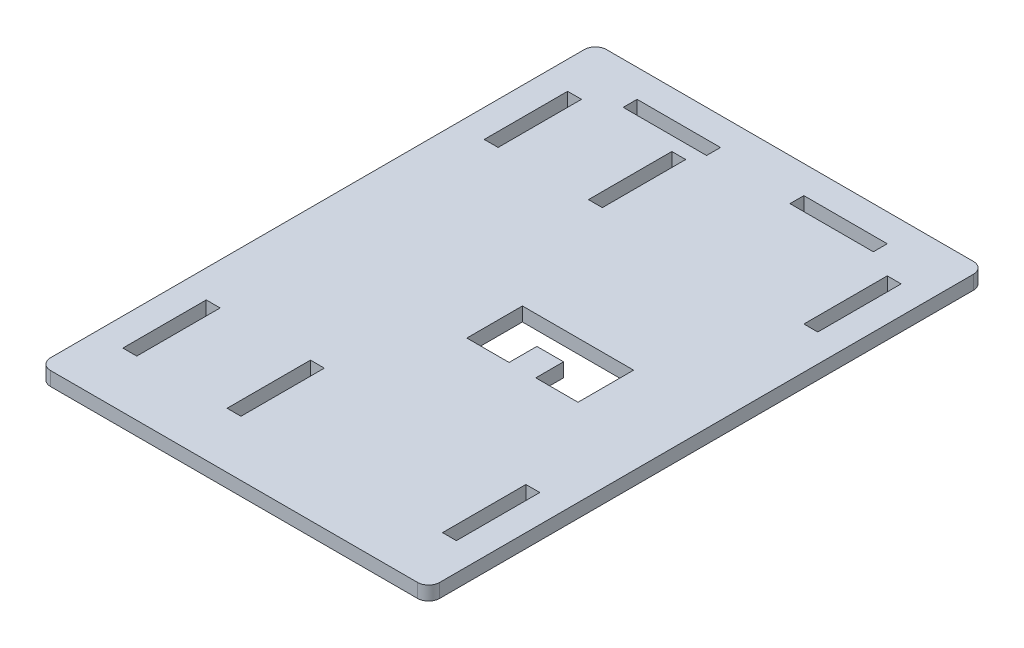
ISO-10303-21;
HEADER;
FILE_DESCRIPTION(('STEP AP214'),'2;1');
FILE_NAME('part.step','',(''),(''),'','','');
FILE_SCHEMA(('AUTOMOTIVE_DESIGN { 1 0 10303 214 1 1 1 1 }'));
ENDSEC;
DATA;
#1=APPLICATION_CONTEXT('core data for automotive mechanical design processes');
#2=APPLICATION_PROTOCOL_DEFINITION('international standard','automotive_design',2000,#1);
#3=PRODUCT_CONTEXT('',#1,'mechanical');
#4=PRODUCT('Part','Part','',(#3));
#5=PRODUCT_RELATED_PRODUCT_CATEGORY('part','',(#4));
#6=PRODUCT_DEFINITION_FORMATION('','',#4);
#7=PRODUCT_DEFINITION_CONTEXT('part definition',#1,'design');
#8=PRODUCT_DEFINITION('design','',#6,#7);
#9=PRODUCT_DEFINITION_SHAPE('','',#8);
#10=(LENGTH_UNIT() NAMED_UNIT(*) SI_UNIT(.MILLI.,.METRE.));
#11=(NAMED_UNIT(*) PLANE_ANGLE_UNIT() SI_UNIT($,.RADIAN.));
#12=(NAMED_UNIT(*) SI_UNIT($,.STERADIAN.) SOLID_ANGLE_UNIT());
#13=UNCERTAINTY_MEASURE_WITH_UNIT(LENGTH_MEASURE(1.E-05),#10,'distance_accuracy_value','');
#14=(GEOMETRIC_REPRESENTATION_CONTEXT(3) GLOBAL_UNCERTAINTY_ASSIGNED_CONTEXT((#13)) GLOBAL_UNIT_ASSIGNED_CONTEXT((#10,
#11,#12)) REPRESENTATION_CONTEXT('',''));
#15=CARTESIAN_POINT('',(0.,0.,0.));
#16=DIRECTION('',(0.,0.,1.));
#17=DIRECTION('',(1.,0.,0.));
#18=AXIS2_PLACEMENT_3D('',#15,#16,#17);
#19=CARTESIAN_POINT('',(0.,3.175,0.));
#20=DIRECTION('',(1.,0.,0.));
#21=DIRECTION('',(0.,0.,-1.));
#22=AXIS2_PLACEMENT_3D('',#19,#20,#21);
#23=PLANE('',#22);
#24=DIRECTION('',(0.,0.,1.));
#25=VECTOR('',#24,1.);
#26=CARTESIAN_POINT('',(0.,0.,0.));
#27=LINE('',#26,#25);
#28=CARTESIAN_POINT('',(0.,0.,-124.46));
#29=VERTEX_POINT('',#28);
#30=CARTESIAN_POINT('',(0.,0.,-2.54));
#31=VERTEX_POINT('',#30);
#32=EDGE_CURVE('E664',#29,#31,#27,.T.);
#33=ORIENTED_EDGE('',*,*,#32,.T.);
#34=DIRECTION('',(0.,-1.,0.));
#35=VECTOR('',#34,1.);
#36=CARTESIAN_POINT('',(0.,3.175,-2.54));
#37=LINE('',#36,#35);
#38=CARTESIAN_POINT('',(0.,3.175,-2.54));
#39=VERTEX_POINT('',#38);
#40=EDGE_CURVE('E719',#31,#39,#37,.F.);
#41=ORIENTED_EDGE('',*,*,#40,.T.);
#42=DIRECTION('',(0.,0.,1.));
#43=VECTOR('',#42,1.);
#44=CARTESIAN_POINT('',(0.,3.175,0.));
#45=LINE('',#44,#43);
#46=CARTESIAN_POINT('',(0.,3.175,-124.46));
#47=VERTEX_POINT('',#46);
#48=EDGE_CURVE('E671',#47,#39,#45,.T.);
#49=ORIENTED_EDGE('',*,*,#48,.F.);
#50=DIRECTION('',(0.,-1.,0.));
#51=VECTOR('',#50,1.);
#52=CARTESIAN_POINT('',(0.,3.175,-124.46));
#53=LINE('',#52,#51);
#54=EDGE_CURVE('E716',#47,#29,#53,.T.);
#55=ORIENTED_EDGE('',*,*,#54,.T.);
#56=EDGE_LOOP('',(#33,#41,#49,#55));
#57=FACE_BOUND('',#56,.T.);
#58=ADVANCED_FACE('F33',(#57),#23,.F.);
#59=CARTESIAN_POINT('',(0.,3.175,0.));
#60=DIRECTION('',(0.,0.,-1.));
#61=DIRECTION('',(-1.,0.,0.));
#62=AXIS2_PLACEMENT_3D('',#59,#60,#61);
#63=PLANE('',#62);
#64=DIRECTION('',(1.,0.,0.));
#65=VECTOR('',#64,1.);
#66=CARTESIAN_POINT('',(0.,0.,0.));
#67=LINE('',#66,#65);
#68=CARTESIAN_POINT('',(2.54,0.,0.));
#69=VERTEX_POINT('',#68);
#70=CARTESIAN_POINT('',(86.36,0.,0.));
#71=VERTEX_POINT('',#70);
#72=EDGE_CURVE('E685',#69,#71,#67,.T.);
#73=ORIENTED_EDGE('',*,*,#72,.T.);
#74=DIRECTION('',(0.,-1.,0.));
#75=VECTOR('',#74,1.);
#76=CARTESIAN_POINT('',(86.36,3.175,0.));
#77=LINE('',#76,#75);
#78=CARTESIAN_POINT('',(86.36,3.175,0.));
#79=VERTEX_POINT('',#78);
#80=EDGE_CURVE('E707',#71,#79,#77,.F.);
#81=ORIENTED_EDGE('',*,*,#80,.T.);
#82=DIRECTION('',(1.,0.,0.));
#83=VECTOR('',#82,1.);
#84=CARTESIAN_POINT('',(0.,3.175,0.));
#85=LINE('',#84,#83);
#86=CARTESIAN_POINT('',(2.54,3.175,0.));
#87=VERTEX_POINT('',#86);
#88=EDGE_CURVE('E674',#87,#79,#85,.T.);
#89=ORIENTED_EDGE('',*,*,#88,.F.);
#90=DIRECTION('',(0.,-1.,0.));
#91=VECTOR('',#90,1.);
#92=CARTESIAN_POINT('',(2.54,3.175,0.));
#93=LINE('',#92,#91);
#94=EDGE_CURVE('E704',#87,#69,#93,.T.);
#95=ORIENTED_EDGE('',*,*,#94,.T.);
#96=EDGE_LOOP('',(#73,#81,#89,#95));
#97=FACE_BOUND('',#96,.T.);
#98=ADVANCED_FACE('F734',(#97),#63,.F.);
#99=CARTESIAN_POINT('',(88.9,3.175,0.));
#100=DIRECTION('',(-1.,0.,0.));
#101=DIRECTION('',(0.,0.,1.));
#102=AXIS2_PLACEMENT_3D('',#99,#100,#101);
#103=PLANE('',#102);
#104=DIRECTION('',(0.,0.,-1.));
#105=VECTOR('',#104,1.);
#106=CARTESIAN_POINT('',(88.9,3.175,0.));
#107=LINE('',#106,#105);
#108=CARTESIAN_POINT('',(88.9,3.175,-2.54));
#109=VERTEX_POINT('',#108);
#110=CARTESIAN_POINT('',(88.9,3.175,-124.46));
#111=VERTEX_POINT('',#110);
#112=EDGE_CURVE('E678',#109,#111,#107,.T.);
#113=ORIENTED_EDGE('',*,*,#112,.F.);
#114=DIRECTION('',(0.,-1.,0.));
#115=VECTOR('',#114,1.);
#116=CARTESIAN_POINT('',(88.9,3.175,-2.54));
#117=LINE('',#116,#115);
#118=CARTESIAN_POINT('',(88.9,0.,-2.54));
#119=VERTEX_POINT('',#118);
#120=EDGE_CURVE('E693',#109,#119,#117,.T.);
#121=ORIENTED_EDGE('',*,*,#120,.T.);
#122=DIRECTION('',(0.,0.,-1.));
#123=VECTOR('',#122,1.);
#124=CARTESIAN_POINT('',(88.9,0.,0.));
#125=LINE('',#124,#123);
#126=CARTESIAN_POINT('',(88.9,0.,-124.46));
#127=VERTEX_POINT('',#126);
#128=EDGE_CURVE('E688',#119,#127,#125,.T.);
#129=ORIENTED_EDGE('',*,*,#128,.T.);
#130=DIRECTION('',(0.,-1.,0.));
#131=VECTOR('',#130,1.);
#132=CARTESIAN_POINT('',(88.9,3.175,-124.46));
#133=LINE('',#132,#131);
#134=EDGE_CURVE('E682',#127,#111,#133,.F.);
#135=ORIENTED_EDGE('',*,*,#134,.T.);
#136=EDGE_LOOP('',(#113,#121,#129,#135));
#137=FACE_BOUND('',#136,.T.);
#138=ADVANCED_FACE('F744',(#137),#103,.F.);
#139=CARTESIAN_POINT('',(88.9,3.175,-127.));
#140=DIRECTION('',(0.,0.,1.));
#141=DIRECTION('',(1.,0.,0.));
#142=AXIS2_PLACEMENT_3D('',#139,#140,#141);
#143=PLANE('',#142);
#144=DIRECTION('',(-1.,0.,0.));
#145=VECTOR('',#144,1.);
#146=CARTESIAN_POINT('',(88.9,3.175,-127.));
#147=LINE('',#146,#145);
#148=CARTESIAN_POINT('',(86.36,3.175,-127.));
#149=VERTEX_POINT('',#148);
#150=CARTESIAN_POINT('',(2.54,3.175,-127.));
#151=VERTEX_POINT('',#150);
#152=EDGE_CURVE('E680',#149,#151,#147,.T.);
#153=ORIENTED_EDGE('',*,*,#152,.F.);
#154=DIRECTION('',(0.,-1.,0.));
#155=VECTOR('',#154,1.);
#156=CARTESIAN_POINT('',(86.36,3.175,-127.));
#157=LINE('',#156,#155);
#158=CARTESIAN_POINT('',(86.36,0.,-127.));
#159=VERTEX_POINT('',#158);
#160=EDGE_CURVE('E11',#149,#159,#157,.T.);
#161=ORIENTED_EDGE('',*,*,#160,.T.);
#162=DIRECTION('',(-1.,0.,0.));
#163=VECTOR('',#162,1.);
#164=CARTESIAN_POINT('',(88.9,0.,-127.));
#165=LINE('',#164,#163);
#166=CARTESIAN_POINT('',(2.54,0.,-127.));
#167=VERTEX_POINT('',#166);
#168=EDGE_CURVE('E675',#159,#167,#165,.T.);
#169=ORIENTED_EDGE('',*,*,#168,.T.);
#170=DIRECTION('',(0.,-1.,0.));
#171=VECTOR('',#170,1.);
#172=CARTESIAN_POINT('',(2.54,3.175,-127.));
#173=LINE('',#172,#171);
#174=EDGE_CURVE('E41',#167,#151,#173,.F.);
#175=ORIENTED_EDGE('',*,*,#174,.T.);
#176=EDGE_LOOP('',(#153,#161,#169,#175));
#177=FACE_BOUND('',#176,.T.);
#178=ADVANCED_FACE('F750',(#177),#143,.F.);
#179=CARTESIAN_POINT('',(0.,3.175,0.));
#180=DIRECTION('',(0.,1.,0.));
#181=DIRECTION('',(0.,0.,1.));
#182=AXIS2_PLACEMENT_3D('',#179,#180,#181);
#183=PLANE('',#182);
#184=DIRECTION('',(0.,0.,-1.));
#185=VECTOR('',#184,1.);
#186=CARTESIAN_POINT('',(69.05625,3.175,-66.675));
#187=LINE('',#186,#185);
#188=CARTESIAN_POINT('',(69.05625,3.175,-53.975));
#189=VERTEX_POINT('',#188);
#190=CARTESIAN_POINT('',(69.05625,3.175,-66.675));
#191=VERTEX_POINT('',#190);
#192=EDGE_CURVE('E346',#189,#191,#187,.T.);
#193=ORIENTED_EDGE('',*,*,#192,.F.);
#194=DIRECTION('',(1.,0.,0.));
#195=VECTOR('',#194,1.);
#196=CARTESIAN_POINT('',(69.05625,3.175,-53.975));
#197=LINE('',#196,#195);
#198=CARTESIAN_POINT('',(59.40425,3.175,-53.975));
#199=VERTEX_POINT('',#198);
#200=EDGE_CURVE('E365',#199,#189,#197,.T.);
#201=ORIENTED_EDGE('',*,*,#200,.F.);
#202=DIRECTION('',(0.,0.,1.));
#203=VECTOR('',#202,1.);
#204=CARTESIAN_POINT('',(59.40425,3.175,-53.975));
#205=LINE('',#204,#203);
#206=CARTESIAN_POINT('',(59.40425,3.175,-60.325));
#207=VERTEX_POINT('',#206);
#208=EDGE_CURVE('E368',#207,#199,#205,.T.);
#209=ORIENTED_EDGE('',*,*,#208,.F.);
#210=DIRECTION('',(1.,0.,0.));
#211=VECTOR('',#210,1.);
#212=CARTESIAN_POINT('',(59.40425,3.175,-60.325));
#213=LINE('',#212,#211);
#214=CARTESIAN_POINT('',(53.30825,3.175,-60.325));
#215=VERTEX_POINT('',#214);
#216=EDGE_CURVE('E396',#215,#207,#213,.T.);
#217=ORIENTED_EDGE('',*,*,#216,.F.);
#218=DIRECTION('',(0.,0.,-1.));
#219=VECTOR('',#218,1.);
#220=CARTESIAN_POINT('',(53.30825,3.175,-60.325));
#221=LINE('',#220,#219);
#222=CARTESIAN_POINT('',(53.30825,3.175,-53.975));
#223=VERTEX_POINT('',#222);
#224=EDGE_CURVE('E393',#223,#215,#221,.T.);
#225=ORIENTED_EDGE('',*,*,#224,.F.);
#226=DIRECTION('',(1.,0.,0.));
#227=VECTOR('',#226,1.);
#228=CARTESIAN_POINT('',(53.30825,3.175,-53.975));
#229=LINE('',#228,#227);
#230=CARTESIAN_POINT('',(43.65625,3.175,-53.975));
#231=VERTEX_POINT('',#230);
#232=EDGE_CURVE('E390',#231,#223,#229,.T.);
#233=ORIENTED_EDGE('',*,*,#232,.F.);
#234=DIRECTION('',(0.,0.,1.));
#235=VECTOR('',#234,1.);
#236=CARTESIAN_POINT('',(43.65625,3.175,-53.975));
#237=LINE('',#236,#235);
#238=CARTESIAN_POINT('',(43.65625,3.175,-66.675));
#239=VERTEX_POINT('',#238);
#240=EDGE_CURVE('E387',#239,#231,#237,.T.);
#241=ORIENTED_EDGE('',*,*,#240,.F.);
#242=DIRECTION('',(-1.,0.,0.));
#243=VECTOR('',#242,1.);
#244=CARTESIAN_POINT('',(69.05625,3.175,-66.675));
#245=LINE('',#244,#243);
#246=EDGE_CURVE('E385',#191,#239,#245,.T.);
#247=ORIENTED_EDGE('',*,*,#246,.F.);
#248=EDGE_LOOP('',(#193,#201,#209,#217,#225,#233,#241,#247));
#249=FACE_BOUND('',#248,.T.);
#250=DIRECTION('',(1.,0.,0.));
#251=VECTOR('',#250,1.);
#252=CARTESIAN_POINT('',(30.1625,3.175,-12.7));
#253=LINE('',#252,#251);
#254=CARTESIAN_POINT('',(30.1625,3.175,-12.7));
#255=VERTEX_POINT('',#254);
#256=CARTESIAN_POINT('',(33.3375,3.175,-12.7));
#257=VERTEX_POINT('',#256);
#258=EDGE_CURVE('E403',#255,#257,#253,.T.);
#259=ORIENTED_EDGE('',*,*,#258,.F.);
#260=DIRECTION('',(0.,0.,1.));
#261=VECTOR('',#260,1.);
#262=CARTESIAN_POINT('',(30.1625,3.175,-12.7));
#263=LINE('',#262,#261);
#264=CARTESIAN_POINT('',(30.1625,3.175,-31.75));
#265=VERTEX_POINT('',#264);
#266=EDGE_CURVE('E419',#265,#255,#263,.T.);
#267=ORIENTED_EDGE('',*,*,#266,.F.);
#268=DIRECTION('',(-1.,0.,0.));
#269=VECTOR('',#268,1.);
#270=CARTESIAN_POINT('',(30.1625,3.175,-31.75));
#271=LINE('',#270,#269);
#272=CARTESIAN_POINT('',(33.3375,3.175,-31.75));
#273=VERTEX_POINT('',#272);
#274=EDGE_CURVE('E433',#273,#265,#271,.T.);
#275=ORIENTED_EDGE('',*,*,#274,.F.);
#276=DIRECTION('',(0.,0.,-1.));
#277=VECTOR('',#276,1.);
#278=CARTESIAN_POINT('',(33.3375,3.175,-12.7));
#279=LINE('',#278,#277);
#280=EDGE_CURVE('E430',#257,#273,#279,.T.);
#281=ORIENTED_EDGE('',*,*,#280,.F.);
#282=EDGE_LOOP('',(#259,#267,#275,#281));
#283=FACE_BOUND('',#282,.T.);
#284=DIRECTION('',(0.,0.,1.));
#285=VECTOR('',#284,1.);
#286=CARTESIAN_POINT('',(30.1625,3.175,-114.3));
#287=LINE('',#286,#285);
#288=CARTESIAN_POINT('',(30.1625,3.175,-114.3));
#289=VERTEX_POINT('',#288);
#290=CARTESIAN_POINT('',(30.1625,3.175,-95.25));
#291=VERTEX_POINT('',#290);
#292=EDGE_CURVE('E440',#289,#291,#287,.T.);
#293=ORIENTED_EDGE('',*,*,#292,.F.);
#294=DIRECTION('',(-1.,0.,0.));
#295=VECTOR('',#294,1.);
#296=CARTESIAN_POINT('',(30.1625,3.175,-114.3));
#297=LINE('',#296,#295);
#298=CARTESIAN_POINT('',(33.3374999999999,3.175,-114.3));
#299=VERTEX_POINT('',#298);
#300=EDGE_CURVE('E451',#299,#289,#297,.T.);
#301=ORIENTED_EDGE('',*,*,#300,.F.);
#302=DIRECTION('',(0.,0.,-1.));
#303=VECTOR('',#302,1.);
#304=CARTESIAN_POINT('',(33.3374999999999,3.175,-114.3));
#305=LINE('',#304,#303);
#306=CARTESIAN_POINT('',(33.3374999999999,3.175,-95.25));
#307=VERTEX_POINT('',#306);
#308=EDGE_CURVE('E465',#307,#299,#305,.T.);
#309=ORIENTED_EDGE('',*,*,#308,.F.);
#310=DIRECTION('',(1.,0.,0.));
#311=VECTOR('',#310,1.);
#312=CARTESIAN_POINT('',(30.1625,3.175,-95.25));
#313=LINE('',#312,#311);
#314=EDGE_CURVE('E462',#291,#307,#313,.T.);
#315=ORIENTED_EDGE('',*,*,#314,.F.);
#316=EDGE_LOOP('',(#293,#301,#309,#315));
#317=FACE_BOUND('',#316,.T.);
#318=DIRECTION('',(-1.,0.,0.));
#319=VECTOR('',#318,1.);
#320=CARTESIAN_POINT('',(73.025,3.175,-120.65));
#321=LINE('',#320,#319);
#322=CARTESIAN_POINT('',(73.025,3.175,-120.65));
#323=VERTEX_POINT('',#322);
#324=CARTESIAN_POINT('',(53.975,3.175,-120.65));
#325=VERTEX_POINT('',#324);
#326=EDGE_CURVE('E472',#323,#325,#321,.T.);
#327=ORIENTED_EDGE('',*,*,#326,.F.);
#328=DIRECTION('',(0.,0.,-1.));
#329=VECTOR('',#328,1.);
#330=CARTESIAN_POINT('',(73.025,3.175,-120.65));
#331=LINE('',#330,#329);
#332=CARTESIAN_POINT('',(73.025,3.175,-117.475));
#333=VERTEX_POINT('',#332);
#334=EDGE_CURVE('E483',#333,#323,#331,.T.);
#335=ORIENTED_EDGE('',*,*,#334,.F.);
#336=DIRECTION('',(1.,0.,0.));
#337=VECTOR('',#336,1.);
#338=CARTESIAN_POINT('',(73.025,3.175,-117.475));
#339=LINE('',#338,#337);
#340=CARTESIAN_POINT('',(53.975,3.175,-117.475));
#341=VERTEX_POINT('',#340);
#342=EDGE_CURVE('E497',#341,#333,#339,.T.);
#343=ORIENTED_EDGE('',*,*,#342,.F.);
#344=DIRECTION('',(0.,0.,1.));
#345=VECTOR('',#344,1.);
#346=CARTESIAN_POINT('',(53.975,3.175,-120.65));
#347=LINE('',#346,#345);
#348=EDGE_CURVE('E494',#325,#341,#347,.T.);
#349=ORIENTED_EDGE('',*,*,#348,.F.);
#350=EDGE_LOOP('',(#327,#335,#343,#349));
#351=FACE_BOUND('',#350,.T.);
#352=DIRECTION('',(0.,0.,1.));
#353=VECTOR('',#352,1.);
#354=CARTESIAN_POINT('',(15.875,3.175,-120.65));
#355=LINE('',#354,#353);
#356=CARTESIAN_POINT('',(15.875,3.175,-120.65));
#357=VERTEX_POINT('',#356);
#358=CARTESIAN_POINT('',(15.875,3.175,-117.475));
#359=VERTEX_POINT('',#358);
#360=EDGE_CURVE('E504',#357,#359,#355,.T.);
#361=ORIENTED_EDGE('',*,*,#360,.F.);
#362=DIRECTION('',(-1.,0.,0.));
#363=VECTOR('',#362,1.);
#364=CARTESIAN_POINT('',(15.875,3.175,-120.65));
#365=LINE('',#364,#363);
#366=CARTESIAN_POINT('',(34.925,3.175,-120.65));
#367=VERTEX_POINT('',#366);
#368=EDGE_CURVE('E515',#367,#357,#365,.T.);
#369=ORIENTED_EDGE('',*,*,#368,.F.);
#370=DIRECTION('',(0.,0.,-1.));
#371=VECTOR('',#370,1.);
#372=CARTESIAN_POINT('',(34.925,3.175,-120.65));
#373=LINE('',#372,#371);
#374=CARTESIAN_POINT('',(34.925,3.175,-117.475));
#375=VERTEX_POINT('',#374);
#376=EDGE_CURVE('E529',#375,#367,#373,.T.);
#377=ORIENTED_EDGE('',*,*,#376,.F.);
#378=DIRECTION('',(1.,0.,0.));
#379=VECTOR('',#378,1.);
#380=CARTESIAN_POINT('',(15.875,3.175,-117.475));
#381=LINE('',#380,#379);
#382=EDGE_CURVE('E526',#359,#375,#381,.T.);
#383=ORIENTED_EDGE('',*,*,#382,.F.);
#384=EDGE_LOOP('',(#361,#369,#377,#383));
#385=FACE_BOUND('',#384,.T.);
#386=DIRECTION('',(1.,0.,0.));
#387=VECTOR('',#386,1.);
#388=CARTESIAN_POINT('',(6.35000000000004,3.175,-12.7));
#389=LINE('',#388,#387);
#390=CARTESIAN_POINT('',(6.35000000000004,3.175,-12.7));
#391=VERTEX_POINT('',#390);
#392=CARTESIAN_POINT('',(9.52500000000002,3.175,-12.7));
#393=VERTEX_POINT('',#392);
#394=EDGE_CURVE('E536',#391,#393,#389,.T.);
#395=ORIENTED_EDGE('',*,*,#394,.F.);
#396=DIRECTION('',(0.,0.,1.));
#397=VECTOR('',#396,1.);
#398=CARTESIAN_POINT('',(6.35000000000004,3.175,-12.7));
#399=LINE('',#398,#397);
#400=CARTESIAN_POINT('',(6.35000000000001,3.175,-31.75));
#401=VERTEX_POINT('',#400);
#402=EDGE_CURVE('E547',#401,#391,#399,.T.);
#403=ORIENTED_EDGE('',*,*,#402,.F.);
#404=DIRECTION('',(-1.,0.,0.));
#405=VECTOR('',#404,1.);
#406=CARTESIAN_POINT('',(6.35000000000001,3.175,-31.75));
#407=LINE('',#406,#405);
#408=CARTESIAN_POINT('',(9.52500000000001,3.175,-31.75));
#409=VERTEX_POINT('',#408);
#410=EDGE_CURVE('E561',#409,#401,#407,.T.);
#411=ORIENTED_EDGE('',*,*,#410,.F.);
#412=DIRECTION('',(0.,0.,-1.));
#413=VECTOR('',#412,1.);
#414=CARTESIAN_POINT('',(9.52500000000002,3.175,-12.7));
#415=LINE('',#414,#413);
#416=EDGE_CURVE('E558',#393,#409,#415,.T.);
#417=ORIENTED_EDGE('',*,*,#416,.F.);
#418=EDGE_LOOP('',(#395,#403,#411,#417));
#419=FACE_BOUND('',#418,.T.);
#420=DIRECTION('',(0.,0.,-1.));
#421=VECTOR('',#420,1.);
#422=CARTESIAN_POINT('',(82.5499999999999,3.175,-12.7));
#423=LINE('',#422,#421);
#424=CARTESIAN_POINT('',(82.5499999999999,3.175,-12.7));
#425=VERTEX_POINT('',#424);
#426=CARTESIAN_POINT('',(82.5499999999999,3.175,-31.75));
#427=VERTEX_POINT('',#426);
#428=EDGE_CURVE('E568',#425,#427,#423,.T.);
#429=ORIENTED_EDGE('',*,*,#428,.F.);
#430=DIRECTION('',(1.,0.,0.));
#431=VECTOR('',#430,1.);
#432=CARTESIAN_POINT('',(82.5499999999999,3.175,-12.7));
#433=LINE('',#432,#431);
#434=CARTESIAN_POINT('',(79.375,3.175,-12.7));
#435=VERTEX_POINT('',#434);
#436=EDGE_CURVE('E579',#435,#425,#433,.T.);
#437=ORIENTED_EDGE('',*,*,#436,.F.);
#438=DIRECTION('',(0.,0.,1.));
#439=VECTOR('',#438,1.);
#440=CARTESIAN_POINT('',(79.375,3.175,-12.7));
#441=LINE('',#440,#439);
#442=CARTESIAN_POINT('',(79.375,3.175,-31.75));
#443=VERTEX_POINT('',#442);
#444=EDGE_CURVE('E593',#443,#435,#441,.T.);
#445=ORIENTED_EDGE('',*,*,#444,.F.);
#446=DIRECTION('',(-1.,0.,0.));
#447=VECTOR('',#446,1.);
#448=CARTESIAN_POINT('',(82.5499999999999,3.175,-31.75));
#449=LINE('',#448,#447);
#450=EDGE_CURVE('E590',#427,#443,#449,.T.);
#451=ORIENTED_EDGE('',*,*,#450,.F.);
#452=EDGE_LOOP('',(#429,#437,#445,#451));
#453=FACE_BOUND('',#452,.T.);
#454=DIRECTION('',(-1.,0.,0.));
#455=VECTOR('',#454,1.);
#456=CARTESIAN_POINT('',(82.55,3.175,-114.3));
#457=LINE('',#456,#455);
#458=CARTESIAN_POINT('',(82.55,3.175,-114.3));
#459=VERTEX_POINT('',#458);
#460=CARTESIAN_POINT('',(79.375,3.175,-114.3));
#461=VERTEX_POINT('',#460);
#462=EDGE_CURVE('E600',#459,#461,#457,.T.);
#463=ORIENTED_EDGE('',*,*,#462,.F.);
#464=DIRECTION('',(0.,0.,-1.));
#465=VECTOR('',#464,1.);
#466=CARTESIAN_POINT('',(82.55,3.175,-114.3));
#467=LINE('',#466,#465);
#468=CARTESIAN_POINT('',(82.5499999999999,3.175,-95.25));
#469=VERTEX_POINT('',#468);
#470=EDGE_CURVE('E611',#469,#459,#467,.T.);
#471=ORIENTED_EDGE('',*,*,#470,.F.);
#472=DIRECTION('',(1.,0.,0.));
#473=VECTOR('',#472,1.);
#474=CARTESIAN_POINT('',(82.5499999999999,3.175,-95.25));
#475=LINE('',#474,#473);
#476=CARTESIAN_POINT('',(79.375,3.175,-95.25));
#477=VERTEX_POINT('',#476);
#478=EDGE_CURVE('E625',#477,#469,#475,.T.);
#479=ORIENTED_EDGE('',*,*,#478,.F.);
#480=DIRECTION('',(0.,0.,1.));
#481=VECTOR('',#480,1.);
#482=CARTESIAN_POINT('',(79.375,3.175,-114.3));
#483=LINE('',#482,#481);
#484=EDGE_CURVE('E622',#461,#477,#483,.T.);
#485=ORIENTED_EDGE('',*,*,#484,.F.);
#486=EDGE_LOOP('',(#463,#471,#479,#485));
#487=FACE_BOUND('',#486,.T.);
#488=DIRECTION('',(0.,0.,1.));
#489=VECTOR('',#488,1.);
#490=CARTESIAN_POINT('',(6.35,3.175,-114.3));
#491=LINE('',#490,#489);
#492=CARTESIAN_POINT('',(6.35,3.175,-114.3));
#493=VERTEX_POINT('',#492);
#494=CARTESIAN_POINT('',(6.35,3.175,-95.25));
#495=VERTEX_POINT('',#494);
#496=EDGE_CURVE('E632',#493,#495,#491,.T.);
#497=ORIENTED_EDGE('',*,*,#496,.F.);
#498=DIRECTION('',(-1.,0.,0.));
#499=VECTOR('',#498,1.);
#500=CARTESIAN_POINT('',(6.35,3.175,-114.3));
#501=LINE('',#500,#499);
#502=CARTESIAN_POINT('',(9.525,3.175,-114.3));
#503=VERTEX_POINT('',#502);
#504=EDGE_CURVE('E643',#503,#493,#501,.T.);
#505=ORIENTED_EDGE('',*,*,#504,.F.);
#506=DIRECTION('',(0.,0.,-1.));
#507=VECTOR('',#506,1.);
#508=CARTESIAN_POINT('',(9.525,3.175,-114.3));
#509=LINE('',#508,#507);
#510=CARTESIAN_POINT('',(9.525,3.175,-95.25));
#511=VERTEX_POINT('',#510);
#512=EDGE_CURVE('E657',#511,#503,#509,.T.);
#513=ORIENTED_EDGE('',*,*,#512,.F.);
#514=DIRECTION('',(1.,0.,0.));
#515=VECTOR('',#514,1.);
#516=CARTESIAN_POINT('',(6.35,3.175,-95.25));
#517=LINE('',#516,#515);
#518=EDGE_CURVE('E654',#495,#511,#517,.T.);
#519=ORIENTED_EDGE('',*,*,#518,.F.);
#520=EDGE_LOOP('',(#497,#505,#513,#519));
#521=FACE_BOUND('',#520,.T.);
#522=ORIENTED_EDGE('',*,*,#88,.T.);
#523=CARTESIAN_POINT('',(86.36,3.175,-2.54));
#524=DIRECTION('',(0.,1.,0.));
#525=DIRECTION('',(0.,0.,1.));
#526=AXIS2_PLACEMENT_3D('',#523,#524,#525);
#527=CIRCLE('',#526,2.54);
#528=EDGE_CURVE('E714',#79,#109,#527,.T.);
#529=ORIENTED_EDGE('',*,*,#528,.T.);
#530=ORIENTED_EDGE('',*,*,#112,.T.);
#531=CARTESIAN_POINT('',(86.36,3.175,-124.46));
#532=DIRECTION('',(0.,1.,0.));
#533=DIRECTION('',(0.,0.,1.));
#534=AXIS2_PLACEMENT_3D('',#531,#532,#533);
#535=CIRCLE('',#534,2.54);
#536=EDGE_CURVE('E54',#111,#149,#535,.T.);
#537=ORIENTED_EDGE('',*,*,#536,.T.);
#538=ORIENTED_EDGE('',*,*,#152,.T.);
#539=CARTESIAN_POINT('',(2.54,3.175,-124.46));
#540=DIRECTION('',(0.,1.,0.));
#541=DIRECTION('',(0.,0.,1.));
#542=AXIS2_PLACEMENT_3D('',#539,#540,#541);
#543=CIRCLE('',#542,2.54);
#544=EDGE_CURVE('E709',#151,#47,#543,.T.);
#545=ORIENTED_EDGE('',*,*,#544,.T.);
#546=ORIENTED_EDGE('',*,*,#48,.T.);
#547=CARTESIAN_POINT('',(2.54,3.175,-2.54));
#548=DIRECTION('',(0.,1.,0.));
#549=DIRECTION('',(0.,0.,1.));
#550=AXIS2_PLACEMENT_3D('',#547,#548,#549);
#551=CIRCLE('',#550,2.54);
#552=EDGE_CURVE('E712',#39,#87,#551,.T.);
#553=ORIENTED_EDGE('',*,*,#552,.T.);
#554=EDGE_LOOP('',(#522,#529,#530,#537,#538,#545,#546,#553));
#555=FACE_BOUND('',#554,.T.);
#556=ADVANCED_FACE('F727',(#249,#283,#317,#351,#385,#419,#453,#487,#521,#555),#183,.T.);
#557=CARTESIAN_POINT('',(0.,0.,0.));
#558=DIRECTION('',(0.,1.,0.));
#559=DIRECTION('',(0.,0.,1.));
#560=AXIS2_PLACEMENT_3D('',#557,#558,#559);
#561=PLANE('',#560);
#562=DIRECTION('',(1.,0.,0.));
#563=VECTOR('',#562,1.);
#564=CARTESIAN_POINT('',(69.05625,0.,-53.975));
#565=LINE('',#564,#563);
#566=CARTESIAN_POINT('',(59.40425,0.,-53.975));
#567=VERTEX_POINT('',#566);
#568=CARTESIAN_POINT('',(69.05625,0.,-53.975));
#569=VERTEX_POINT('',#568);
#570=EDGE_CURVE('E351',#567,#569,#565,.T.);
#571=ORIENTED_EDGE('',*,*,#570,.T.);
#572=DIRECTION('',(0.,0.,-1.));
#573=VECTOR('',#572,1.);
#574=CARTESIAN_POINT('',(69.05625,0.,-66.675));
#575=LINE('',#574,#573);
#576=CARTESIAN_POINT('',(69.05625,0.,-66.675));
#577=VERTEX_POINT('',#576);
#578=EDGE_CURVE('E343',#569,#577,#575,.T.);
#579=ORIENTED_EDGE('',*,*,#578,.T.);
#580=DIRECTION('',(-1.,0.,0.));
#581=VECTOR('',#580,1.);
#582=CARTESIAN_POINT('',(69.05625,0.,-66.675));
#583=LINE('',#582,#581);
#584=CARTESIAN_POINT('',(43.65625,0.,-66.675));
#585=VERTEX_POINT('',#584);
#586=EDGE_CURVE('E355',#577,#585,#583,.T.);
#587=ORIENTED_EDGE('',*,*,#586,.T.);
#588=DIRECTION('',(0.,0.,1.));
#589=VECTOR('',#588,1.);
#590=CARTESIAN_POINT('',(43.65625,0.,-53.975));
#591=LINE('',#590,#589);
#592=CARTESIAN_POINT('',(43.65625,0.,-53.975));
#593=VERTEX_POINT('',#592);
#594=EDGE_CURVE('E359',#585,#593,#591,.T.);
#595=ORIENTED_EDGE('',*,*,#594,.T.);
#596=DIRECTION('',(1.,0.,0.));
#597=VECTOR('',#596,1.);
#598=CARTESIAN_POINT('',(53.30825,0.,-53.975));
#599=LINE('',#598,#597);
#600=CARTESIAN_POINT('',(53.30825,0.,-53.975));
#601=VERTEX_POINT('',#600);
#602=EDGE_CURVE('E372',#593,#601,#599,.T.);
#603=ORIENTED_EDGE('',*,*,#602,.T.);
#604=DIRECTION('',(0.,0.,-1.));
#605=VECTOR('',#604,1.);
#606=CARTESIAN_POINT('',(53.30825,0.,-60.325));
#607=LINE('',#606,#605);
#608=CARTESIAN_POINT('',(53.30825,0.,-60.325));
#609=VERTEX_POINT('',#608);
#610=EDGE_CURVE('E375',#601,#609,#607,.T.);
#611=ORIENTED_EDGE('',*,*,#610,.T.);
#612=DIRECTION('',(1.,0.,0.));
#613=VECTOR('',#612,1.);
#614=CARTESIAN_POINT('',(59.40425,0.,-60.325));
#615=LINE('',#614,#613);
#616=CARTESIAN_POINT('',(59.40425,0.,-60.325));
#617=VERTEX_POINT('',#616);
#618=EDGE_CURVE('E378',#609,#617,#615,.T.);
#619=ORIENTED_EDGE('',*,*,#618,.T.);
#620=DIRECTION('',(0.,0.,1.));
#621=VECTOR('',#620,1.);
#622=CARTESIAN_POINT('',(59.40425,0.,-53.975));
#623=LINE('',#622,#621);
#624=EDGE_CURVE('E381',#617,#567,#623,.T.);
#625=ORIENTED_EDGE('',*,*,#624,.T.);
#626=EDGE_LOOP('',(#571,#579,#587,#595,#603,#611,#619,#625));
#627=FACE_BOUND('',#626,.T.);
#628=DIRECTION('',(0.,0.,1.));
#629=VECTOR('',#628,1.);
#630=CARTESIAN_POINT('',(30.1625,0.,-12.7));
#631=LINE('',#630,#629);
#632=CARTESIAN_POINT('',(30.1625,0.,-31.75));
#633=VERTEX_POINT('',#632);
#634=CARTESIAN_POINT('',(30.1625,0.,-12.7));
#635=VERTEX_POINT('',#634);
#636=EDGE_CURVE('E425',#633,#635,#631,.T.);
#637=ORIENTED_EDGE('',*,*,#636,.T.);
#638=DIRECTION('',(1.,0.,0.));
#639=VECTOR('',#638,1.);
#640=CARTESIAN_POINT('',(30.1625,0.,-12.7));
#641=LINE('',#640,#639);
#642=CARTESIAN_POINT('',(33.3375,0.,-12.7));
#643=VERTEX_POINT('',#642);
#644=EDGE_CURVE('E415',#635,#643,#641,.T.);
#645=ORIENTED_EDGE('',*,*,#644,.T.);
#646=DIRECTION('',(0.,0.,-1.));
#647=VECTOR('',#646,1.);
#648=CARTESIAN_POINT('',(33.3375,0.,-12.7));
#649=LINE('',#648,#647);
#650=CARTESIAN_POINT('',(33.3375,0.,-31.75));
#651=VERTEX_POINT('',#650);
#652=EDGE_CURVE('E418',#643,#651,#649,.T.);
#653=ORIENTED_EDGE('',*,*,#652,.T.);
#654=DIRECTION('',(-1.,0.,0.));
#655=VECTOR('',#654,1.);
#656=CARTESIAN_POINT('',(30.1625,0.,-31.75));
#657=LINE('',#656,#655);
#658=EDGE_CURVE('E422',#651,#633,#657,.T.);
#659=ORIENTED_EDGE('',*,*,#658,.T.);
#660=EDGE_LOOP('',(#637,#645,#653,#659));
#661=FACE_BOUND('',#660,.T.);
#662=DIRECTION('',(-1.,0.,0.));
#663=VECTOR('',#662,1.);
#664=CARTESIAN_POINT('',(30.1625,0.,-114.3));
#665=LINE('',#664,#663);
#666=CARTESIAN_POINT('',(33.3374999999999,0.,-114.3));
#667=VERTEX_POINT('',#666);
#668=CARTESIAN_POINT('',(30.1625,0.,-114.3));
#669=VERTEX_POINT('',#668);
#670=EDGE_CURVE('E457',#667,#669,#665,.T.);
#671=ORIENTED_EDGE('',*,*,#670,.T.);
#672=DIRECTION('',(0.,0.,1.));
#673=VECTOR('',#672,1.);
#674=CARTESIAN_POINT('',(30.1625,0.,-114.3));
#675=LINE('',#674,#673);
#676=CARTESIAN_POINT('',(30.1625,0.,-95.25));
#677=VERTEX_POINT('',#676);
#678=EDGE_CURVE('E447',#669,#677,#675,.T.);
#679=ORIENTED_EDGE('',*,*,#678,.T.);
#680=DIRECTION('',(1.,0.,0.));
#681=VECTOR('',#680,1.);
#682=CARTESIAN_POINT('',(30.1625,0.,-95.25));
#683=LINE('',#682,#681);
#684=CARTESIAN_POINT('',(33.3374999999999,0.,-95.25));
#685=VERTEX_POINT('',#684);
#686=EDGE_CURVE('E450',#677,#685,#683,.T.);
#687=ORIENTED_EDGE('',*,*,#686,.T.);
#688=DIRECTION('',(0.,0.,-1.));
#689=VECTOR('',#688,1.);
#690=CARTESIAN_POINT('',(33.3374999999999,0.,-114.3));
#691=LINE('',#690,#689);
#692=EDGE_CURVE('E454',#685,#667,#691,.T.);
#693=ORIENTED_EDGE('',*,*,#692,.T.);
#694=EDGE_LOOP('',(#671,#679,#687,#693));
#695=FACE_BOUND('',#694,.T.);
#696=DIRECTION('',(0.,0.,-1.));
#697=VECTOR('',#696,1.);
#698=CARTESIAN_POINT('',(73.025,0.,-120.65));
#699=LINE('',#698,#697);
#700=CARTESIAN_POINT('',(73.025,0.,-117.475));
#701=VERTEX_POINT('',#700);
#702=CARTESIAN_POINT('',(73.025,0.,-120.65));
#703=VERTEX_POINT('',#702);
#704=EDGE_CURVE('E489',#701,#703,#699,.T.);
#705=ORIENTED_EDGE('',*,*,#704,.T.);
#706=DIRECTION('',(-1.,0.,0.));
#707=VECTOR('',#706,1.);
#708=CARTESIAN_POINT('',(73.025,0.,-120.65));
#709=LINE('',#708,#707);
#710=CARTESIAN_POINT('',(53.975,0.,-120.65));
#711=VERTEX_POINT('',#710);
#712=EDGE_CURVE('E479',#703,#711,#709,.T.);
#713=ORIENTED_EDGE('',*,*,#712,.T.);
#714=DIRECTION('',(0.,0.,1.));
#715=VECTOR('',#714,1.);
#716=CARTESIAN_POINT('',(53.975,0.,-120.65));
#717=LINE('',#716,#715);
#718=CARTESIAN_POINT('',(53.975,0.,-117.475));
#719=VERTEX_POINT('',#718);
#720=EDGE_CURVE('E482',#711,#719,#717,.T.);
#721=ORIENTED_EDGE('',*,*,#720,.T.);
#722=DIRECTION('',(1.,0.,0.));
#723=VECTOR('',#722,1.);
#724=CARTESIAN_POINT('',(73.025,0.,-117.475));
#725=LINE('',#724,#723);
#726=EDGE_CURVE('E486',#719,#701,#725,.T.);
#727=ORIENTED_EDGE('',*,*,#726,.T.);
#728=EDGE_LOOP('',(#705,#713,#721,#727));
#729=FACE_BOUND('',#728,.T.);
#730=DIRECTION('',(-1.,0.,0.));
#731=VECTOR('',#730,1.);
#732=CARTESIAN_POINT('',(15.875,0.,-120.65));
#733=LINE('',#732,#731);
#734=CARTESIAN_POINT('',(34.925,0.,-120.65));
#735=VERTEX_POINT('',#734);
#736=CARTESIAN_POINT('',(15.875,0.,-120.65));
#737=VERTEX_POINT('',#736);
#738=EDGE_CURVE('E521',#735,#737,#733,.T.);
#739=ORIENTED_EDGE('',*,*,#738,.T.);
#740=DIRECTION('',(0.,0.,1.));
#741=VECTOR('',#740,1.);
#742=CARTESIAN_POINT('',(15.875,0.,-120.65));
#743=LINE('',#742,#741);
#744=CARTESIAN_POINT('',(15.875,0.,-117.475));
#745=VERTEX_POINT('',#744);
#746=EDGE_CURVE('E511',#737,#745,#743,.T.);
#747=ORIENTED_EDGE('',*,*,#746,.T.);
#748=DIRECTION('',(1.,0.,0.));
#749=VECTOR('',#748,1.);
#750=CARTESIAN_POINT('',(15.875,0.,-117.475));
#751=LINE('',#750,#749);
#752=CARTESIAN_POINT('',(34.925,0.,-117.475));
#753=VERTEX_POINT('',#752);
#754=EDGE_CURVE('E514',#745,#753,#751,.T.);
#755=ORIENTED_EDGE('',*,*,#754,.T.);
#756=DIRECTION('',(0.,0.,-1.));
#757=VECTOR('',#756,1.);
#758=CARTESIAN_POINT('',(34.925,0.,-120.65));
#759=LINE('',#758,#757);
#760=EDGE_CURVE('E518',#753,#735,#759,.T.);
#761=ORIENTED_EDGE('',*,*,#760,.T.);
#762=EDGE_LOOP('',(#739,#747,#755,#761));
#763=FACE_BOUND('',#762,.T.);
#764=DIRECTION('',(0.,0.,1.));
#765=VECTOR('',#764,1.);
#766=CARTESIAN_POINT('',(6.35000000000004,0.,-12.7));
#767=LINE('',#766,#765);
#768=CARTESIAN_POINT('',(6.35000000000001,0.,-31.75));
#769=VERTEX_POINT('',#768);
#770=CARTESIAN_POINT('',(6.35000000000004,0.,-12.7));
#771=VERTEX_POINT('',#770);
#772=EDGE_CURVE('E553',#769,#771,#767,.T.);
#773=ORIENTED_EDGE('',*,*,#772,.T.);
#774=DIRECTION('',(1.,0.,0.));
#775=VECTOR('',#774,1.);
#776=CARTESIAN_POINT('',(6.35000000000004,0.,-12.7));
#777=LINE('',#776,#775);
#778=CARTESIAN_POINT('',(9.52500000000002,0.,-12.7));
#779=VERTEX_POINT('',#778);
#780=EDGE_CURVE('E543',#771,#779,#777,.T.);
#781=ORIENTED_EDGE('',*,*,#780,.T.);
#782=DIRECTION('',(0.,0.,-1.));
#783=VECTOR('',#782,1.);
#784=CARTESIAN_POINT('',(9.52500000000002,0.,-12.7));
#785=LINE('',#784,#783);
#786=CARTESIAN_POINT('',(9.52500000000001,0.,-31.75));
#787=VERTEX_POINT('',#786);
#788=EDGE_CURVE('E546',#779,#787,#785,.T.);
#789=ORIENTED_EDGE('',*,*,#788,.T.);
#790=DIRECTION('',(-1.,0.,0.));
#791=VECTOR('',#790,1.);
#792=CARTESIAN_POINT('',(6.35000000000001,0.,-31.75));
#793=LINE('',#792,#791);
#794=EDGE_CURVE('E550',#787,#769,#793,.T.);
#795=ORIENTED_EDGE('',*,*,#794,.T.);
#796=EDGE_LOOP('',(#773,#781,#789,#795));
#797=FACE_BOUND('',#796,.T.);
#798=DIRECTION('',(1.,0.,0.));
#799=VECTOR('',#798,1.);
#800=CARTESIAN_POINT('',(82.5499999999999,0.,-12.7));
#801=LINE('',#800,#799);
#802=CARTESIAN_POINT('',(79.375,0.,-12.7));
#803=VERTEX_POINT('',#802);
#804=CARTESIAN_POINT('',(82.5499999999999,0.,-12.7));
#805=VERTEX_POINT('',#804);
#806=EDGE_CURVE('E585',#803,#805,#801,.T.);
#807=ORIENTED_EDGE('',*,*,#806,.T.);
#808=DIRECTION('',(0.,0.,-1.));
#809=VECTOR('',#808,1.);
#810=CARTESIAN_POINT('',(82.5499999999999,0.,-12.7));
#811=LINE('',#810,#809);
#812=CARTESIAN_POINT('',(82.5499999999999,0.,-31.75));
#813=VERTEX_POINT('',#812);
#814=EDGE_CURVE('E575',#805,#813,#811,.T.);
#815=ORIENTED_EDGE('',*,*,#814,.T.);
#816=DIRECTION('',(-1.,0.,0.));
#817=VECTOR('',#816,1.);
#818=CARTESIAN_POINT('',(82.5499999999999,0.,-31.75));
#819=LINE('',#818,#817);
#820=CARTESIAN_POINT('',(79.375,0.,-31.75));
#821=VERTEX_POINT('',#820);
#822=EDGE_CURVE('E578',#813,#821,#819,.T.);
#823=ORIENTED_EDGE('',*,*,#822,.T.);
#824=DIRECTION('',(0.,0.,1.));
#825=VECTOR('',#824,1.);
#826=CARTESIAN_POINT('',(79.375,0.,-12.7));
#827=LINE('',#826,#825);
#828=EDGE_CURVE('E582',#821,#803,#827,.T.);
#829=ORIENTED_EDGE('',*,*,#828,.T.);
#830=EDGE_LOOP('',(#807,#815,#823,#829));
#831=FACE_BOUND('',#830,.T.);
#832=DIRECTION('',(0.,0.,-1.));
#833=VECTOR('',#832,1.);
#834=CARTESIAN_POINT('',(82.55,0.,-114.3));
#835=LINE('',#834,#833);
#836=CARTESIAN_POINT('',(82.5499999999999,0.,-95.25));
#837=VERTEX_POINT('',#836);
#838=CARTESIAN_POINT('',(82.55,0.,-114.3));
#839=VERTEX_POINT('',#838);
#840=EDGE_CURVE('E617',#837,#839,#835,.T.);
#841=ORIENTED_EDGE('',*,*,#840,.T.);
#842=DIRECTION('',(-1.,0.,0.));
#843=VECTOR('',#842,1.);
#844=CARTESIAN_POINT('',(82.55,0.,-114.3));
#845=LINE('',#844,#843);
#846=CARTESIAN_POINT('',(79.375,0.,-114.3));
#847=VERTEX_POINT('',#846);
#848=EDGE_CURVE('E607',#839,#847,#845,.T.);
#849=ORIENTED_EDGE('',*,*,#848,.T.);
#850=DIRECTION('',(0.,0.,1.));
#851=VECTOR('',#850,1.);
#852=CARTESIAN_POINT('',(79.375,0.,-114.3));
#853=LINE('',#852,#851);
#854=CARTESIAN_POINT('',(79.375,0.,-95.25));
#855=VERTEX_POINT('',#854);
#856=EDGE_CURVE('E610',#847,#855,#853,.T.);
#857=ORIENTED_EDGE('',*,*,#856,.T.);
#858=DIRECTION('',(1.,0.,0.));
#859=VECTOR('',#858,1.);
#860=CARTESIAN_POINT('',(82.5499999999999,0.,-95.25));
#861=LINE('',#860,#859);
#862=EDGE_CURVE('E614',#855,#837,#861,.T.);
#863=ORIENTED_EDGE('',*,*,#862,.T.);
#864=EDGE_LOOP('',(#841,#849,#857,#863));
#865=FACE_BOUND('',#864,.T.);
#866=DIRECTION('',(-1.,0.,0.));
#867=VECTOR('',#866,1.);
#868=CARTESIAN_POINT('',(6.35,0.,-114.3));
#869=LINE('',#868,#867);
#870=CARTESIAN_POINT('',(9.525,0.,-114.3));
#871=VERTEX_POINT('',#870);
#872=CARTESIAN_POINT('',(6.35,0.,-114.3));
#873=VERTEX_POINT('',#872);
#874=EDGE_CURVE('E649',#871,#873,#869,.T.);
#875=ORIENTED_EDGE('',*,*,#874,.T.);
#876=DIRECTION('',(0.,0.,1.));
#877=VECTOR('',#876,1.);
#878=CARTESIAN_POINT('',(6.35,0.,-114.3));
#879=LINE('',#878,#877);
#880=CARTESIAN_POINT('',(6.35,0.,-95.25));
#881=VERTEX_POINT('',#880);
#882=EDGE_CURVE('E639',#873,#881,#879,.T.);
#883=ORIENTED_EDGE('',*,*,#882,.T.);
#884=DIRECTION('',(1.,0.,0.));
#885=VECTOR('',#884,1.);
#886=CARTESIAN_POINT('',(6.35,0.,-95.25));
#887=LINE('',#886,#885);
#888=CARTESIAN_POINT('',(9.525,0.,-95.25));
#889=VERTEX_POINT('',#888);
#890=EDGE_CURVE('E642',#881,#889,#887,.T.);
#891=ORIENTED_EDGE('',*,*,#890,.T.);
#892=DIRECTION('',(0.,0.,-1.));
#893=VECTOR('',#892,1.);
#894=CARTESIAN_POINT('',(9.525,0.,-114.3));
#895=LINE('',#894,#893);
#896=EDGE_CURVE('E646',#889,#871,#895,.T.);
#897=ORIENTED_EDGE('',*,*,#896,.T.);
#898=EDGE_LOOP('',(#875,#883,#891,#897));
#899=FACE_BOUND('',#898,.T.);
#900=ORIENTED_EDGE('',*,*,#128,.F.);
#901=CARTESIAN_POINT('',(86.36,0.,-2.54));
#902=DIRECTION('',(0.,1.,0.));
#903=DIRECTION('',(0.,0.,1.));
#904=AXIS2_PLACEMENT_3D('',#901,#902,#903);
#905=CIRCLE('',#904,2.54);
#906=EDGE_CURVE('E702',#119,#71,#905,.F.);
#907=ORIENTED_EDGE('',*,*,#906,.T.);
#908=ORIENTED_EDGE('',*,*,#72,.F.);
#909=CARTESIAN_POINT('',(2.54,0.,-2.54));
#910=DIRECTION('',(0.,1.,0.));
#911=DIRECTION('',(0.,0.,1.));
#912=AXIS2_PLACEMENT_3D('',#909,#910,#911);
#913=CIRCLE('',#912,2.54);
#914=EDGE_CURVE('E700',#69,#31,#913,.F.);
#915=ORIENTED_EDGE('',*,*,#914,.T.);
#916=ORIENTED_EDGE('',*,*,#32,.F.);
#917=CARTESIAN_POINT('',(2.54,0.,-124.46));
#918=DIRECTION('',(0.,1.,0.));
#919=DIRECTION('',(0.,0.,1.));
#920=AXIS2_PLACEMENT_3D('',#917,#918,#919);
#921=CIRCLE('',#920,2.54);
#922=EDGE_CURVE('E696',#29,#167,#921,.F.);
#923=ORIENTED_EDGE('',*,*,#922,.T.);
#924=ORIENTED_EDGE('',*,*,#168,.F.);
#925=CARTESIAN_POINT('',(86.36,0.,-124.46));
#926=DIRECTION('',(0.,1.,0.));
#927=DIRECTION('',(0.,0.,1.));
#928=AXIS2_PLACEMENT_3D('',#925,#926,#927);
#929=CIRCLE('',#928,2.54);
#930=EDGE_CURVE('E698',#159,#127,#929,.F.);
#931=ORIENTED_EDGE('',*,*,#930,.T.);
#932=EDGE_LOOP('',(#900,#907,#908,#915,#916,#923,#924,#931));
#933=FACE_BOUND('',#932,.T.);
#934=ADVANCED_FACE('F361',(#627,#661,#695,#729,#763,#797,#831,#865,#899,#933),#561,.F.);
#935=CARTESIAN_POINT('',(6.35,0.,-114.3));
#936=DIRECTION('',(-1.,0.,0.));
#937=DIRECTION('',(0.,0.,1.));
#938=AXIS2_PLACEMENT_3D('',#935,#936,#937);
#939=PLANE('',#938);
#940=ORIENTED_EDGE('',*,*,#496,.T.);
#941=DIRECTION('',(0.,1.,0.));
#942=VECTOR('',#941,1.);
#943=CARTESIAN_POINT('',(6.35,0.,-95.25));
#944=LINE('',#943,#942);
#945=EDGE_CURVE('E652',#881,#495,#944,.T.);
#946=ORIENTED_EDGE('',*,*,#945,.F.);
#947=ORIENTED_EDGE('',*,*,#882,.F.);
#948=DIRECTION('',(0.,1.,0.));
#949=VECTOR('',#948,1.);
#950=CARTESIAN_POINT('',(6.35,0.,-114.3));
#951=LINE('',#950,#949);
#952=EDGE_CURVE('E662',#873,#493,#951,.T.);
#953=ORIENTED_EDGE('',*,*,#952,.T.);
#954=EDGE_LOOP('',(#940,#946,#947,#953));
#955=FACE_BOUND('',#954,.T.);
#956=ADVANCED_FACE('F1135',(#955),#939,.F.);
#957=CARTESIAN_POINT('',(6.35,0.,-114.3));
#958=DIRECTION('',(0.,0.,-1.));
#959=DIRECTION('',(-1.,0.,0.));
#960=AXIS2_PLACEMENT_3D('',#957,#958,#959);
#961=PLANE('',#960);
#962=ORIENTED_EDGE('',*,*,#504,.T.);
#963=ORIENTED_EDGE('',*,*,#952,.F.);
#964=ORIENTED_EDGE('',*,*,#874,.F.);
#965=DIRECTION('',(0.,1.,0.));
#966=VECTOR('',#965,1.);
#967=CARTESIAN_POINT('',(9.525,0.,-114.3));
#968=LINE('',#967,#966);
#969=EDGE_CURVE('E665',#871,#503,#968,.T.);
#970=ORIENTED_EDGE('',*,*,#969,.T.);
#971=EDGE_LOOP('',(#962,#963,#964,#970));
#972=FACE_BOUND('',#971,.T.);
#973=ADVANCED_FACE('F1126',(#972),#961,.F.);
#974=CARTESIAN_POINT('',(9.525,0.,-114.3));
#975=DIRECTION('',(1.,0.,0.));
#976=DIRECTION('',(0.,0.,-1.));
#977=AXIS2_PLACEMENT_3D('',#974,#975,#976);
#978=PLANE('',#977);
#979=ORIENTED_EDGE('',*,*,#512,.T.);
#980=ORIENTED_EDGE('',*,*,#969,.F.);
#981=ORIENTED_EDGE('',*,*,#896,.F.);
#982=DIRECTION('',(0.,1.,0.));
#983=VECTOR('',#982,1.);
#984=CARTESIAN_POINT('',(9.525,0.,-95.25));
#985=LINE('',#984,#983);
#986=EDGE_CURVE('E667',#889,#511,#985,.T.);
#987=ORIENTED_EDGE('',*,*,#986,.T.);
#988=EDGE_LOOP('',(#979,#980,#981,#987));
#989=FACE_BOUND('',#988,.T.);
#990=ADVANCED_FACE('F1117',(#989),#978,.F.);
#991=CARTESIAN_POINT('',(6.35,0.,-95.25));
#992=DIRECTION('',(0.,0.,1.));
#993=DIRECTION('',(1.,0.,0.));
#994=AXIS2_PLACEMENT_3D('',#991,#992,#993);
#995=PLANE('',#994);
#996=ORIENTED_EDGE('',*,*,#518,.T.);
#997=ORIENTED_EDGE('',*,*,#986,.F.);
#998=ORIENTED_EDGE('',*,*,#890,.F.);
#999=ORIENTED_EDGE('',*,*,#945,.T.);
#1000=EDGE_LOOP('',(#996,#997,#998,#999));
#1001=FACE_BOUND('',#1000,.T.);
#1002=ADVANCED_FACE('F1108',(#1001),#995,.F.);
#1003=CARTESIAN_POINT('',(82.55,0.,-114.3));
#1004=DIRECTION('',(0.,0.,-1.));
#1005=DIRECTION('',(-1.,0.,0.));
#1006=AXIS2_PLACEMENT_3D('',#1003,#1004,#1005);
#1007=PLANE('',#1006);
#1008=ORIENTED_EDGE('',*,*,#462,.T.);
#1009=DIRECTION('',(0.,1.,0.));
#1010=VECTOR('',#1009,1.);
#1011=CARTESIAN_POINT('',(79.375,0.,-114.3));
#1012=LINE('',#1011,#1010);
#1013=EDGE_CURVE('E620',#847,#461,#1012,.T.);
#1014=ORIENTED_EDGE('',*,*,#1013,.F.);
#1015=ORIENTED_EDGE('',*,*,#848,.F.);
#1016=DIRECTION('',(0.,1.,0.));
#1017=VECTOR('',#1016,1.);
#1018=CARTESIAN_POINT('',(82.55,0.,-114.3));
#1019=LINE('',#1018,#1017);
#1020=EDGE_CURVE('E630',#839,#459,#1019,.T.);
#1021=ORIENTED_EDGE('',*,*,#1020,.T.);
#1022=EDGE_LOOP('',(#1008,#1014,#1015,#1021));
#1023=FACE_BOUND('',#1022,.T.);
#1024=ADVANCED_FACE('F1099',(#1023),#1007,.F.);
#1025=CARTESIAN_POINT('',(82.55,0.,-114.3));
#1026=DIRECTION('',(1.,0.,0.));
#1027=DIRECTION('',(0.,0.,-1.));
#1028=AXIS2_PLACEMENT_3D('',#1025,#1026,#1027);
#1029=PLANE('',#1028);
#1030=ORIENTED_EDGE('',*,*,#470,.T.);
#1031=ORIENTED_EDGE('',*,*,#1020,.F.);
#1032=ORIENTED_EDGE('',*,*,#840,.F.);
#1033=DIRECTION('',(0.,1.,0.));
#1034=VECTOR('',#1033,1.);
#1035=CARTESIAN_POINT('',(82.5499999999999,0.,-95.25));
#1036=LINE('',#1035,#1034);
#1037=EDGE_CURVE('E633',#837,#469,#1036,.T.);
#1038=ORIENTED_EDGE('',*,*,#1037,.T.);
#1039=EDGE_LOOP('',(#1030,#1031,#1032,#1038));
#1040=FACE_BOUND('',#1039,.T.);
#1041=ADVANCED_FACE('F1090',(#1040),#1029,.F.);
#1042=CARTESIAN_POINT('',(82.5499999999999,0.,-95.25));
#1043=DIRECTION('',(0.,0.,1.));
#1044=DIRECTION('',(1.,0.,0.));
#1045=AXIS2_PLACEMENT_3D('',#1042,#1043,#1044);
#1046=PLANE('',#1045);
#1047=ORIENTED_EDGE('',*,*,#478,.T.);
#1048=ORIENTED_EDGE('',*,*,#1037,.F.);
#1049=ORIENTED_EDGE('',*,*,#862,.F.);
#1050=DIRECTION('',(0.,1.,0.));
#1051=VECTOR('',#1050,1.);
#1052=CARTESIAN_POINT('',(79.375,0.,-95.25));
#1053=LINE('',#1052,#1051);
#1054=EDGE_CURVE('E635',#855,#477,#1053,.T.);
#1055=ORIENTED_EDGE('',*,*,#1054,.T.);
#1056=EDGE_LOOP('',(#1047,#1048,#1049,#1055));
#1057=FACE_BOUND('',#1056,.T.);
#1058=ADVANCED_FACE('F1081',(#1057),#1046,.F.);
#1059=CARTESIAN_POINT('',(79.375,0.,-114.3));
#1060=DIRECTION('',(-1.,0.,0.));
#1061=DIRECTION('',(0.,0.,1.));
#1062=AXIS2_PLACEMENT_3D('',#1059,#1060,#1061);
#1063=PLANE('',#1062);
#1064=ORIENTED_EDGE('',*,*,#484,.T.);
#1065=ORIENTED_EDGE('',*,*,#1054,.F.);
#1066=ORIENTED_EDGE('',*,*,#856,.F.);
#1067=ORIENTED_EDGE('',*,*,#1013,.T.);
#1068=EDGE_LOOP('',(#1064,#1065,#1066,#1067));
#1069=FACE_BOUND('',#1068,.T.);
#1070=ADVANCED_FACE('F1072',(#1069),#1063,.F.);
#1071=CARTESIAN_POINT('',(82.5499999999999,0.,-12.7));
#1072=DIRECTION('',(1.,0.,0.));
#1073=DIRECTION('',(0.,0.,-1.));
#1074=AXIS2_PLACEMENT_3D('',#1071,#1072,#1073);
#1075=PLANE('',#1074);
#1076=ORIENTED_EDGE('',*,*,#428,.T.);
#1077=DIRECTION('',(0.,1.,0.));
#1078=VECTOR('',#1077,1.);
#1079=CARTESIAN_POINT('',(82.5499999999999,0.,-31.75));
#1080=LINE('',#1079,#1078);
#1081=EDGE_CURVE('E588',#813,#427,#1080,.T.);
#1082=ORIENTED_EDGE('',*,*,#1081,.F.);
#1083=ORIENTED_EDGE('',*,*,#814,.F.);
#1084=DIRECTION('',(0.,1.,0.));
#1085=VECTOR('',#1084,1.);
#1086=CARTESIAN_POINT('',(82.5499999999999,0.,-12.7));
#1087=LINE('',#1086,#1085);
#1088=EDGE_CURVE('E598',#805,#425,#1087,.T.);
#1089=ORIENTED_EDGE('',*,*,#1088,.T.);
#1090=EDGE_LOOP('',(#1076,#1082,#1083,#1089));
#1091=FACE_BOUND('',#1090,.T.);
#1092=ADVANCED_FACE('F1063',(#1091),#1075,.F.);
#1093=CARTESIAN_POINT('',(82.5499999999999,0.,-12.7));
#1094=DIRECTION('',(0.,0.,1.));
#1095=DIRECTION('',(1.,0.,0.));
#1096=AXIS2_PLACEMENT_3D('',#1093,#1094,#1095);
#1097=PLANE('',#1096);
#1098=ORIENTED_EDGE('',*,*,#436,.T.);
#1099=ORIENTED_EDGE('',*,*,#1088,.F.);
#1100=ORIENTED_EDGE('',*,*,#806,.F.);
#1101=DIRECTION('',(0.,1.,0.));
#1102=VECTOR('',#1101,1.);
#1103=CARTESIAN_POINT('',(79.375,0.,-12.7));
#1104=LINE('',#1103,#1102);
#1105=EDGE_CURVE('E601',#803,#435,#1104,.T.);
#1106=ORIENTED_EDGE('',*,*,#1105,.T.);
#1107=EDGE_LOOP('',(#1098,#1099,#1100,#1106));
#1108=FACE_BOUND('',#1107,.T.);
#1109=ADVANCED_FACE('F1054',(#1108),#1097,.F.);
#1110=CARTESIAN_POINT('',(79.375,0.,-12.7));
#1111=DIRECTION('',(-1.,0.,0.));
#1112=DIRECTION('',(0.,0.,1.));
#1113=AXIS2_PLACEMENT_3D('',#1110,#1111,#1112);
#1114=PLANE('',#1113);
#1115=ORIENTED_EDGE('',*,*,#444,.T.);
#1116=ORIENTED_EDGE('',*,*,#1105,.F.);
#1117=ORIENTED_EDGE('',*,*,#828,.F.);
#1118=DIRECTION('',(0.,1.,0.));
#1119=VECTOR('',#1118,1.);
#1120=CARTESIAN_POINT('',(79.375,0.,-31.75));
#1121=LINE('',#1120,#1119);
#1122=EDGE_CURVE('E603',#821,#443,#1121,.T.);
#1123=ORIENTED_EDGE('',*,*,#1122,.T.);
#1124=EDGE_LOOP('',(#1115,#1116,#1117,#1123));
#1125=FACE_BOUND('',#1124,.T.);
#1126=ADVANCED_FACE('F1045',(#1125),#1114,.F.);
#1127=CARTESIAN_POINT('',(82.5499999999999,0.,-31.75));
#1128=DIRECTION('',(0.,0.,-1.));
#1129=DIRECTION('',(-1.,0.,0.));
#1130=AXIS2_PLACEMENT_3D('',#1127,#1128,#1129);
#1131=PLANE('',#1130);
#1132=ORIENTED_EDGE('',*,*,#450,.T.);
#1133=ORIENTED_EDGE('',*,*,#1122,.F.);
#1134=ORIENTED_EDGE('',*,*,#822,.F.);
#1135=ORIENTED_EDGE('',*,*,#1081,.T.);
#1136=EDGE_LOOP('',(#1132,#1133,#1134,#1135));
#1137=FACE_BOUND('',#1136,.T.);
#1138=ADVANCED_FACE('F1036',(#1137),#1131,.F.);
#1139=CARTESIAN_POINT('',(6.35000000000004,0.,-12.7));
#1140=DIRECTION('',(0.,0.,1.));
#1141=DIRECTION('',(1.,0.,0.));
#1142=AXIS2_PLACEMENT_3D('',#1139,#1140,#1141);
#1143=PLANE('',#1142);
#1144=ORIENTED_EDGE('',*,*,#394,.T.);
#1145=DIRECTION('',(0.,1.,0.));
#1146=VECTOR('',#1145,1.);
#1147=CARTESIAN_POINT('',(9.52500000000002,0.,-12.7));
#1148=LINE('',#1147,#1146);
#1149=EDGE_CURVE('E556',#779,#393,#1148,.T.);
#1150=ORIENTED_EDGE('',*,*,#1149,.F.);
#1151=ORIENTED_EDGE('',*,*,#780,.F.);
#1152=DIRECTION('',(0.,1.,0.));
#1153=VECTOR('',#1152,1.);
#1154=CARTESIAN_POINT('',(6.35000000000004,0.,-12.7));
#1155=LINE('',#1154,#1153);
#1156=EDGE_CURVE('E566',#771,#391,#1155,.T.);
#1157=ORIENTED_EDGE('',*,*,#1156,.T.);
#1158=EDGE_LOOP('',(#1144,#1150,#1151,#1157));
#1159=FACE_BOUND('',#1158,.T.);
#1160=ADVANCED_FACE('F1027',(#1159),#1143,.F.);
#1161=CARTESIAN_POINT('',(6.35000000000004,0.,-12.7));
#1162=DIRECTION('',(-1.,0.,0.));
#1163=DIRECTION('',(0.,0.,1.));
#1164=AXIS2_PLACEMENT_3D('',#1161,#1162,#1163);
#1165=PLANE('',#1164);
#1166=ORIENTED_EDGE('',*,*,#402,.T.);
#1167=ORIENTED_EDGE('',*,*,#1156,.F.);
#1168=ORIENTED_EDGE('',*,*,#772,.F.);
#1169=DIRECTION('',(0.,1.,0.));
#1170=VECTOR('',#1169,1.);
#1171=CARTESIAN_POINT('',(6.35000000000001,0.,-31.75));
#1172=LINE('',#1171,#1170);
#1173=EDGE_CURVE('E569',#769,#401,#1172,.T.);
#1174=ORIENTED_EDGE('',*,*,#1173,.T.);
#1175=EDGE_LOOP('',(#1166,#1167,#1168,#1174));
#1176=FACE_BOUND('',#1175,.T.);
#1177=ADVANCED_FACE('F1018',(#1176),#1165,.F.);
#1178=CARTESIAN_POINT('',(6.35000000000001,0.,-31.75));
#1179=DIRECTION('',(0.,0.,-1.));
#1180=DIRECTION('',(-1.,0.,0.));
#1181=AXIS2_PLACEMENT_3D('',#1178,#1179,#1180);
#1182=PLANE('',#1181);
#1183=ORIENTED_EDGE('',*,*,#410,.T.);
#1184=ORIENTED_EDGE('',*,*,#1173,.F.);
#1185=ORIENTED_EDGE('',*,*,#794,.F.);
#1186=DIRECTION('',(0.,1.,0.));
#1187=VECTOR('',#1186,1.);
#1188=CARTESIAN_POINT('',(9.52500000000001,0.,-31.75));
#1189=LINE('',#1188,#1187);
#1190=EDGE_CURVE('E571',#787,#409,#1189,.T.);
#1191=ORIENTED_EDGE('',*,*,#1190,.T.);
#1192=EDGE_LOOP('',(#1183,#1184,#1185,#1191));
#1193=FACE_BOUND('',#1192,.T.);
#1194=ADVANCED_FACE('F1009',(#1193),#1182,.F.);
#1195=CARTESIAN_POINT('',(9.52500000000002,0.,-12.7));
#1196=DIRECTION('',(1.,0.,0.));
#1197=DIRECTION('',(0.,0.,-1.));
#1198=AXIS2_PLACEMENT_3D('',#1195,#1196,#1197);
#1199=PLANE('',#1198);
#1200=ORIENTED_EDGE('',*,*,#416,.T.);
#1201=ORIENTED_EDGE('',*,*,#1190,.F.);
#1202=ORIENTED_EDGE('',*,*,#788,.F.);
#1203=ORIENTED_EDGE('',*,*,#1149,.T.);
#1204=EDGE_LOOP('',(#1200,#1201,#1202,#1203));
#1205=FACE_BOUND('',#1204,.T.);
#1206=ADVANCED_FACE('F1000',(#1205),#1199,.F.);
#1207=CARTESIAN_POINT('',(15.875,0.,-120.65));
#1208=DIRECTION('',(-1.,0.,0.));
#1209=DIRECTION('',(0.,0.,1.));
#1210=AXIS2_PLACEMENT_3D('',#1207,#1208,#1209);
#1211=PLANE('',#1210);
#1212=ORIENTED_EDGE('',*,*,#360,.T.);
#1213=DIRECTION('',(0.,1.,0.));
#1214=VECTOR('',#1213,1.);
#1215=CARTESIAN_POINT('',(15.875,0.,-117.475));
#1216=LINE('',#1215,#1214);
#1217=EDGE_CURVE('E524',#745,#359,#1216,.T.);
#1218=ORIENTED_EDGE('',*,*,#1217,.F.);
#1219=ORIENTED_EDGE('',*,*,#746,.F.);
#1220=DIRECTION('',(0.,1.,0.));
#1221=VECTOR('',#1220,1.);
#1222=CARTESIAN_POINT('',(15.875,0.,-120.65));
#1223=LINE('',#1222,#1221);
#1224=EDGE_CURVE('E534',#737,#357,#1223,.T.);
#1225=ORIENTED_EDGE('',*,*,#1224,.T.);
#1226=EDGE_LOOP('',(#1212,#1218,#1219,#1225));
#1227=FACE_BOUND('',#1226,.T.);
#1228=ADVANCED_FACE('F991',(#1227),#1211,.F.);
#1229=CARTESIAN_POINT('',(15.875,0.,-120.65));
#1230=DIRECTION('',(0.,0.,-1.));
#1231=DIRECTION('',(-1.,0.,0.));
#1232=AXIS2_PLACEMENT_3D('',#1229,#1230,#1231);
#1233=PLANE('',#1232);
#1234=ORIENTED_EDGE('',*,*,#368,.T.);
#1235=ORIENTED_EDGE('',*,*,#1224,.F.);
#1236=ORIENTED_EDGE('',*,*,#738,.F.);
#1237=DIRECTION('',(0.,1.,0.));
#1238=VECTOR('',#1237,1.);
#1239=CARTESIAN_POINT('',(34.925,0.,-120.65));
#1240=LINE('',#1239,#1238);
#1241=EDGE_CURVE('E537',#735,#367,#1240,.T.);
#1242=ORIENTED_EDGE('',*,*,#1241,.T.);
#1243=EDGE_LOOP('',(#1234,#1235,#1236,#1242));
#1244=FACE_BOUND('',#1243,.T.);
#1245=ADVANCED_FACE('F982',(#1244),#1233,.F.);
#1246=CARTESIAN_POINT('',(34.925,0.,-120.65));
#1247=DIRECTION('',(1.,0.,0.));
#1248=DIRECTION('',(0.,0.,-1.));
#1249=AXIS2_PLACEMENT_3D('',#1246,#1247,#1248);
#1250=PLANE('',#1249);
#1251=ORIENTED_EDGE('',*,*,#376,.T.);
#1252=ORIENTED_EDGE('',*,*,#1241,.F.);
#1253=ORIENTED_EDGE('',*,*,#760,.F.);
#1254=DIRECTION('',(0.,1.,0.));
#1255=VECTOR('',#1254,1.);
#1256=CARTESIAN_POINT('',(34.925,0.,-117.475));
#1257=LINE('',#1256,#1255);
#1258=EDGE_CURVE('E539',#753,#375,#1257,.T.);
#1259=ORIENTED_EDGE('',*,*,#1258,.T.);
#1260=EDGE_LOOP('',(#1251,#1252,#1253,#1259));
#1261=FACE_BOUND('',#1260,.T.);
#1262=ADVANCED_FACE('F973',(#1261),#1250,.F.);
#1263=CARTESIAN_POINT('',(15.875,0.,-117.475));
#1264=DIRECTION('',(0.,0.,1.));
#1265=DIRECTION('',(1.,0.,0.));
#1266=AXIS2_PLACEMENT_3D('',#1263,#1264,#1265);
#1267=PLANE('',#1266);
#1268=ORIENTED_EDGE('',*,*,#382,.T.);
#1269=ORIENTED_EDGE('',*,*,#1258,.F.);
#1270=ORIENTED_EDGE('',*,*,#754,.F.);
#1271=ORIENTED_EDGE('',*,*,#1217,.T.);
#1272=EDGE_LOOP('',(#1268,#1269,#1270,#1271));
#1273=FACE_BOUND('',#1272,.T.);
#1274=ADVANCED_FACE('F964',(#1273),#1267,.F.);
#1275=CARTESIAN_POINT('',(73.025,0.,-120.65));
#1276=DIRECTION('',(0.,0.,-1.));
#1277=DIRECTION('',(-1.,0.,0.));
#1278=AXIS2_PLACEMENT_3D('',#1275,#1276,#1277);
#1279=PLANE('',#1278);
#1280=ORIENTED_EDGE('',*,*,#326,.T.);
#1281=DIRECTION('',(0.,1.,0.));
#1282=VECTOR('',#1281,1.);
#1283=CARTESIAN_POINT('',(53.975,0.,-120.65));
#1284=LINE('',#1283,#1282);
#1285=EDGE_CURVE('E492',#711,#325,#1284,.T.);
#1286=ORIENTED_EDGE('',*,*,#1285,.F.);
#1287=ORIENTED_EDGE('',*,*,#712,.F.);
#1288=DIRECTION('',(0.,1.,0.));
#1289=VECTOR('',#1288,1.);
#1290=CARTESIAN_POINT('',(73.025,0.,-120.65));
#1291=LINE('',#1290,#1289);
#1292=EDGE_CURVE('E502',#703,#323,#1291,.T.);
#1293=ORIENTED_EDGE('',*,*,#1292,.T.);
#1294=EDGE_LOOP('',(#1280,#1286,#1287,#1293));
#1295=FACE_BOUND('',#1294,.T.);
#1296=ADVANCED_FACE('F955',(#1295),#1279,.F.);
#1297=CARTESIAN_POINT('',(73.025,0.,-120.65));
#1298=DIRECTION('',(1.,0.,0.));
#1299=DIRECTION('',(0.,0.,-1.));
#1300=AXIS2_PLACEMENT_3D('',#1297,#1298,#1299);
#1301=PLANE('',#1300);
#1302=ORIENTED_EDGE('',*,*,#334,.T.);
#1303=ORIENTED_EDGE('',*,*,#1292,.F.);
#1304=ORIENTED_EDGE('',*,*,#704,.F.);
#1305=DIRECTION('',(0.,1.,0.));
#1306=VECTOR('',#1305,1.);
#1307=CARTESIAN_POINT('',(73.025,0.,-117.475));
#1308=LINE('',#1307,#1306);
#1309=EDGE_CURVE('E505',#701,#333,#1308,.T.);
#1310=ORIENTED_EDGE('',*,*,#1309,.T.);
#1311=EDGE_LOOP('',(#1302,#1303,#1304,#1310));
#1312=FACE_BOUND('',#1311,.T.);
#1313=ADVANCED_FACE('F946',(#1312),#1301,.F.);
#1314=CARTESIAN_POINT('',(73.025,0.,-117.475));
#1315=DIRECTION('',(0.,0.,1.));
#1316=DIRECTION('',(1.,0.,0.));
#1317=AXIS2_PLACEMENT_3D('',#1314,#1315,#1316);
#1318=PLANE('',#1317);
#1319=ORIENTED_EDGE('',*,*,#342,.T.);
#1320=ORIENTED_EDGE('',*,*,#1309,.F.);
#1321=ORIENTED_EDGE('',*,*,#726,.F.);
#1322=DIRECTION('',(0.,1.,0.));
#1323=VECTOR('',#1322,1.);
#1324=CARTESIAN_POINT('',(53.975,0.,-117.475));
#1325=LINE('',#1324,#1323);
#1326=EDGE_CURVE('E507',#719,#341,#1325,.T.);
#1327=ORIENTED_EDGE('',*,*,#1326,.T.);
#1328=EDGE_LOOP('',(#1319,#1320,#1321,#1327));
#1329=FACE_BOUND('',#1328,.T.);
#1330=ADVANCED_FACE('F937',(#1329),#1318,.F.);
#1331=CARTESIAN_POINT('',(53.975,0.,-120.65));
#1332=DIRECTION('',(-1.,0.,0.));
#1333=DIRECTION('',(0.,0.,1.));
#1334=AXIS2_PLACEMENT_3D('',#1331,#1332,#1333);
#1335=PLANE('',#1334);
#1336=ORIENTED_EDGE('',*,*,#348,.T.);
#1337=ORIENTED_EDGE('',*,*,#1326,.F.);
#1338=ORIENTED_EDGE('',*,*,#720,.F.);
#1339=ORIENTED_EDGE('',*,*,#1285,.T.);
#1340=EDGE_LOOP('',(#1336,#1337,#1338,#1339));
#1341=FACE_BOUND('',#1340,.T.);
#1342=ADVANCED_FACE('F928',(#1341),#1335,.F.);
#1343=CARTESIAN_POINT('',(30.1625,0.,-114.3));
#1344=DIRECTION('',(-1.,0.,0.));
#1345=DIRECTION('',(0.,0.,1.));
#1346=AXIS2_PLACEMENT_3D('',#1343,#1344,#1345);
#1347=PLANE('',#1346);
#1348=ORIENTED_EDGE('',*,*,#292,.T.);
#1349=DIRECTION('',(0.,1.,0.));
#1350=VECTOR('',#1349,1.);
#1351=CARTESIAN_POINT('',(30.1625,0.,-95.25));
#1352=LINE('',#1351,#1350);
#1353=EDGE_CURVE('E460',#677,#291,#1352,.T.);
#1354=ORIENTED_EDGE('',*,*,#1353,.F.);
#1355=ORIENTED_EDGE('',*,*,#678,.F.);
#1356=DIRECTION('',(0.,1.,0.));
#1357=VECTOR('',#1356,1.);
#1358=CARTESIAN_POINT('',(30.1625,0.,-114.3));
#1359=LINE('',#1358,#1357);
#1360=EDGE_CURVE('E470',#669,#289,#1359,.T.);
#1361=ORIENTED_EDGE('',*,*,#1360,.T.);
#1362=EDGE_LOOP('',(#1348,#1354,#1355,#1361));
#1363=FACE_BOUND('',#1362,.T.);
#1364=ADVANCED_FACE('F919',(#1363),#1347,.F.);
#1365=CARTESIAN_POINT('',(30.1625,0.,-114.3));
#1366=DIRECTION('',(0.,0.,-1.));
#1367=DIRECTION('',(-1.,0.,0.));
#1368=AXIS2_PLACEMENT_3D('',#1365,#1366,#1367);
#1369=PLANE('',#1368);
#1370=ORIENTED_EDGE('',*,*,#300,.T.);
#1371=ORIENTED_EDGE('',*,*,#1360,.F.);
#1372=ORIENTED_EDGE('',*,*,#670,.F.);
#1373=DIRECTION('',(0.,1.,0.));
#1374=VECTOR('',#1373,1.);
#1375=CARTESIAN_POINT('',(33.3374999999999,0.,-114.3));
#1376=LINE('',#1375,#1374);
#1377=EDGE_CURVE('E473',#667,#299,#1376,.T.);
#1378=ORIENTED_EDGE('',*,*,#1377,.T.);
#1379=EDGE_LOOP('',(#1370,#1371,#1372,#1378));
#1380=FACE_BOUND('',#1379,.T.);
#1381=ADVANCED_FACE('F910',(#1380),#1369,.F.);
#1382=CARTESIAN_POINT('',(33.3374999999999,0.,-114.3));
#1383=DIRECTION('',(1.,0.,0.));
#1384=DIRECTION('',(0.,0.,-1.));
#1385=AXIS2_PLACEMENT_3D('',#1382,#1383,#1384);
#1386=PLANE('',#1385);
#1387=ORIENTED_EDGE('',*,*,#308,.T.);
#1388=ORIENTED_EDGE('',*,*,#1377,.F.);
#1389=ORIENTED_EDGE('',*,*,#692,.F.);
#1390=DIRECTION('',(0.,1.,0.));
#1391=VECTOR('',#1390,1.);
#1392=CARTESIAN_POINT('',(33.3374999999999,0.,-95.25));
#1393=LINE('',#1392,#1391);
#1394=EDGE_CURVE('E475',#685,#307,#1393,.T.);
#1395=ORIENTED_EDGE('',*,*,#1394,.T.);
#1396=EDGE_LOOP('',(#1387,#1388,#1389,#1395));
#1397=FACE_BOUND('',#1396,.T.);
#1398=ADVANCED_FACE('F901',(#1397),#1386,.F.);
#1399=CARTESIAN_POINT('',(30.1625,0.,-95.25));
#1400=DIRECTION('',(0.,0.,1.));
#1401=DIRECTION('',(1.,0.,0.));
#1402=AXIS2_PLACEMENT_3D('',#1399,#1400,#1401);
#1403=PLANE('',#1402);
#1404=ORIENTED_EDGE('',*,*,#314,.T.);
#1405=ORIENTED_EDGE('',*,*,#1394,.F.);
#1406=ORIENTED_EDGE('',*,*,#686,.F.);
#1407=ORIENTED_EDGE('',*,*,#1353,.T.);
#1408=EDGE_LOOP('',(#1404,#1405,#1406,#1407));
#1409=FACE_BOUND('',#1408,.T.);
#1410=ADVANCED_FACE('F892',(#1409),#1403,.F.);
#1411=CARTESIAN_POINT('',(30.1625,0.,-12.7));
#1412=DIRECTION('',(0.,0.,1.));
#1413=DIRECTION('',(1.,0.,0.));
#1414=AXIS2_PLACEMENT_3D('',#1411,#1412,#1413);
#1415=PLANE('',#1414);
#1416=ORIENTED_EDGE('',*,*,#258,.T.);
#1417=DIRECTION('',(0.,1.,0.));
#1418=VECTOR('',#1417,1.);
#1419=CARTESIAN_POINT('',(33.3375,0.,-12.7));
#1420=LINE('',#1419,#1418);
#1421=EDGE_CURVE('E428',#643,#257,#1420,.T.);
#1422=ORIENTED_EDGE('',*,*,#1421,.F.);
#1423=ORIENTED_EDGE('',*,*,#644,.F.);
#1424=DIRECTION('',(0.,1.,0.));
#1425=VECTOR('',#1424,1.);
#1426=CARTESIAN_POINT('',(30.1625,0.,-12.7));
#1427=LINE('',#1426,#1425);
#1428=EDGE_CURVE('E438',#635,#255,#1427,.T.);
#1429=ORIENTED_EDGE('',*,*,#1428,.T.);
#1430=EDGE_LOOP('',(#1416,#1422,#1423,#1429));
#1431=FACE_BOUND('',#1430,.T.);
#1432=ADVANCED_FACE('F883',(#1431),#1415,.F.);
#1433=CARTESIAN_POINT('',(30.1625,0.,-12.7));
#1434=DIRECTION('',(-1.,0.,0.));
#1435=DIRECTION('',(0.,0.,1.));
#1436=AXIS2_PLACEMENT_3D('',#1433,#1434,#1435);
#1437=PLANE('',#1436);
#1438=ORIENTED_EDGE('',*,*,#266,.T.);
#1439=ORIENTED_EDGE('',*,*,#1428,.F.);
#1440=ORIENTED_EDGE('',*,*,#636,.F.);
#1441=DIRECTION('',(0.,1.,0.));
#1442=VECTOR('',#1441,1.);
#1443=CARTESIAN_POINT('',(30.1625,0.,-31.75));
#1444=LINE('',#1443,#1442);
#1445=EDGE_CURVE('E441',#633,#265,#1444,.T.);
#1446=ORIENTED_EDGE('',*,*,#1445,.T.);
#1447=EDGE_LOOP('',(#1438,#1439,#1440,#1446));
#1448=FACE_BOUND('',#1447,.T.);
#1449=ADVANCED_FACE('F874',(#1448),#1437,.F.);
#1450=CARTESIAN_POINT('',(30.1625,0.,-31.75));
#1451=DIRECTION('',(0.,0.,-1.));
#1452=DIRECTION('',(-1.,0.,0.));
#1453=AXIS2_PLACEMENT_3D('',#1450,#1451,#1452);
#1454=PLANE('',#1453);
#1455=ORIENTED_EDGE('',*,*,#274,.T.);
#1456=ORIENTED_EDGE('',*,*,#1445,.F.);
#1457=ORIENTED_EDGE('',*,*,#658,.F.);
#1458=DIRECTION('',(0.,1.,0.));
#1459=VECTOR('',#1458,1.);
#1460=CARTESIAN_POINT('',(33.3375,0.,-31.75));
#1461=LINE('',#1460,#1459);
#1462=EDGE_CURVE('E443',#651,#273,#1461,.T.);
#1463=ORIENTED_EDGE('',*,*,#1462,.T.);
#1464=EDGE_LOOP('',(#1455,#1456,#1457,#1463));
#1465=FACE_BOUND('',#1464,.T.);
#1466=ADVANCED_FACE('F865',(#1465),#1454,.F.);
#1467=CARTESIAN_POINT('',(33.3375,0.,-12.7));
#1468=DIRECTION('',(1.,0.,0.));
#1469=DIRECTION('',(0.,0.,-1.));
#1470=AXIS2_PLACEMENT_3D('',#1467,#1468,#1469);
#1471=PLANE('',#1470);
#1472=ORIENTED_EDGE('',*,*,#280,.T.);
#1473=ORIENTED_EDGE('',*,*,#1462,.F.);
#1474=ORIENTED_EDGE('',*,*,#652,.F.);
#1475=ORIENTED_EDGE('',*,*,#1421,.T.);
#1476=EDGE_LOOP('',(#1472,#1473,#1474,#1475));
#1477=FACE_BOUND('',#1476,.T.);
#1478=ADVANCED_FACE('F857',(#1477),#1471,.F.);
#1479=CARTESIAN_POINT('',(69.05625,0.,-66.675));
#1480=DIRECTION('',(1.,0.,0.));
#1481=DIRECTION('',(0.,0.,-1.));
#1482=AXIS2_PLACEMENT_3D('',#1479,#1480,#1481);
#1483=PLANE('',#1482);
#1484=ORIENTED_EDGE('',*,*,#192,.T.);
#1485=DIRECTION('',(0.,1.,0.));
#1486=VECTOR('',#1485,1.);
#1487=CARTESIAN_POINT('',(69.05625,0.,-66.675));
#1488=LINE('',#1487,#1486);
#1489=EDGE_CURVE('E339',#577,#191,#1488,.T.);
#1490=ORIENTED_EDGE('',*,*,#1489,.F.);
#1491=ORIENTED_EDGE('',*,*,#578,.F.);
#1492=DIRECTION('',(0.,1.,0.));
#1493=VECTOR('',#1492,1.);
#1494=CARTESIAN_POINT('',(69.05625,0.,-53.975));
#1495=LINE('',#1494,#1493);
#1496=EDGE_CURVE('E401',#569,#189,#1495,.T.);
#1497=ORIENTED_EDGE('',*,*,#1496,.T.);
#1498=EDGE_LOOP('',(#1484,#1490,#1491,#1497));
#1499=FACE_BOUND('',#1498,.T.);
#1500=ADVANCED_FACE('F341',(#1499),#1483,.F.);
#1501=CARTESIAN_POINT('',(69.05625,0.,-53.975));
#1502=DIRECTION('',(0.,0.,1.));
#1503=DIRECTION('',(1.,0.,0.));
#1504=AXIS2_PLACEMENT_3D('',#1501,#1502,#1503);
#1505=PLANE('',#1504);
#1506=ORIENTED_EDGE('',*,*,#200,.T.);
#1507=ORIENTED_EDGE('',*,*,#1496,.F.);
#1508=ORIENTED_EDGE('',*,*,#570,.F.);
#1509=DIRECTION('',(0.,1.,0.));
#1510=VECTOR('',#1509,1.);
#1511=CARTESIAN_POINT('',(59.40425,0.,-53.975));
#1512=LINE('',#1511,#1510);
#1513=EDGE_CURVE('E404',#567,#199,#1512,.T.);
#1514=ORIENTED_EDGE('',*,*,#1513,.T.);
#1515=EDGE_LOOP('',(#1506,#1507,#1508,#1514));
#1516=FACE_BOUND('',#1515,.T.);
#1517=ADVANCED_FACE('F840',(#1516),#1505,.F.);
#1518=CARTESIAN_POINT('',(59.40425,0.,-53.975));
#1519=DIRECTION('',(-1.,0.,0.));
#1520=DIRECTION('',(0.,0.,1.));
#1521=AXIS2_PLACEMENT_3D('',#1518,#1519,#1520);
#1522=PLANE('',#1521);
#1523=ORIENTED_EDGE('',*,*,#208,.T.);
#1524=ORIENTED_EDGE('',*,*,#1513,.F.);
#1525=ORIENTED_EDGE('',*,*,#624,.F.);
#1526=DIRECTION('',(0.,1.,0.));
#1527=VECTOR('',#1526,1.);
#1528=CARTESIAN_POINT('',(59.40425,0.,-60.325));
#1529=LINE('',#1528,#1527);
#1530=EDGE_CURVE('E406',#617,#207,#1529,.T.);
#1531=ORIENTED_EDGE('',*,*,#1530,.T.);
#1532=EDGE_LOOP('',(#1523,#1524,#1525,#1531));
#1533=FACE_BOUND('',#1532,.T.);
#1534=ADVANCED_FACE('F831',(#1533),#1522,.F.);
#1535=CARTESIAN_POINT('',(59.40425,0.,-60.325));
#1536=DIRECTION('',(0.,0.,1.));
#1537=DIRECTION('',(1.,0.,0.));
#1538=AXIS2_PLACEMENT_3D('',#1535,#1536,#1537);
#1539=PLANE('',#1538);
#1540=ORIENTED_EDGE('',*,*,#216,.T.);
#1541=ORIENTED_EDGE('',*,*,#1530,.F.);
#1542=ORIENTED_EDGE('',*,*,#618,.F.);
#1543=DIRECTION('',(0.,1.,0.));
#1544=VECTOR('',#1543,1.);
#1545=CARTESIAN_POINT('',(53.30825,0.,-60.325));
#1546=LINE('',#1545,#1544);
#1547=EDGE_CURVE('E408',#609,#215,#1546,.T.);
#1548=ORIENTED_EDGE('',*,*,#1547,.T.);
#1549=EDGE_LOOP('',(#1540,#1541,#1542,#1548));
#1550=FACE_BOUND('',#1549,.T.);
#1551=ADVANCED_FACE('F822',(#1550),#1539,.F.);
#1552=CARTESIAN_POINT('',(53.30825,0.,-60.325));
#1553=DIRECTION('',(1.,0.,0.));
#1554=DIRECTION('',(0.,0.,-1.));
#1555=AXIS2_PLACEMENT_3D('',#1552,#1553,#1554);
#1556=PLANE('',#1555);
#1557=ORIENTED_EDGE('',*,*,#224,.T.);
#1558=ORIENTED_EDGE('',*,*,#1547,.F.);
#1559=ORIENTED_EDGE('',*,*,#610,.F.);
#1560=DIRECTION('',(0.,1.,0.));
#1561=VECTOR('',#1560,1.);
#1562=CARTESIAN_POINT('',(53.30825,0.,-53.975));
#1563=LINE('',#1562,#1561);
#1564=EDGE_CURVE('E410',#601,#223,#1563,.T.);
#1565=ORIENTED_EDGE('',*,*,#1564,.T.);
#1566=EDGE_LOOP('',(#1557,#1558,#1559,#1565));
#1567=FACE_BOUND('',#1566,.T.);
#1568=ADVANCED_FACE('F813',(#1567),#1556,.F.);
#1569=CARTESIAN_POINT('',(53.30825,0.,-53.975));
#1570=DIRECTION('',(0.,0.,1.));
#1571=DIRECTION('',(1.,0.,0.));
#1572=AXIS2_PLACEMENT_3D('',#1569,#1570,#1571);
#1573=PLANE('',#1572);
#1574=ORIENTED_EDGE('',*,*,#232,.T.);
#1575=ORIENTED_EDGE('',*,*,#1564,.F.);
#1576=ORIENTED_EDGE('',*,*,#602,.F.);
#1577=DIRECTION('',(0.,1.,0.));
#1578=VECTOR('',#1577,1.);
#1579=CARTESIAN_POINT('',(43.65625,0.,-53.975));
#1580=LINE('',#1579,#1578);
#1581=EDGE_CURVE('E412',#593,#231,#1580,.T.);
#1582=ORIENTED_EDGE('',*,*,#1581,.T.);
#1583=EDGE_LOOP('',(#1574,#1575,#1576,#1582));
#1584=FACE_BOUND('',#1583,.T.);
#1585=ADVANCED_FACE('F804',(#1584),#1573,.F.);
#1586=CARTESIAN_POINT('',(43.65625,0.,-53.975));
#1587=DIRECTION('',(-1.,0.,0.));
#1588=DIRECTION('',(0.,0.,1.));
#1589=AXIS2_PLACEMENT_3D('',#1586,#1587,#1588);
#1590=PLANE('',#1589);
#1591=ORIENTED_EDGE('',*,*,#240,.T.);
#1592=ORIENTED_EDGE('',*,*,#1581,.F.);
#1593=ORIENTED_EDGE('',*,*,#594,.F.);
#1594=DIRECTION('',(0.,1.,0.));
#1595=VECTOR('',#1594,1.);
#1596=CARTESIAN_POINT('',(43.65625,0.,-66.675));
#1597=LINE('',#1596,#1595);
#1598=EDGE_CURVE('E350',#585,#239,#1597,.T.);
#1599=ORIENTED_EDGE('',*,*,#1598,.T.);
#1600=EDGE_LOOP('',(#1591,#1592,#1593,#1599));
#1601=FACE_BOUND('',#1600,.T.);
#1602=ADVANCED_FACE('F796',(#1601),#1590,.F.);
#1603=CARTESIAN_POINT('',(69.05625,0.,-66.675));
#1604=DIRECTION('',(0.,0.,-1.));
#1605=DIRECTION('',(-1.,0.,0.));
#1606=AXIS2_PLACEMENT_3D('',#1603,#1604,#1605);
#1607=PLANE('',#1606);
#1608=ORIENTED_EDGE('',*,*,#246,.T.);
#1609=ORIENTED_EDGE('',*,*,#1598,.F.);
#1610=ORIENTED_EDGE('',*,*,#586,.F.);
#1611=ORIENTED_EDGE('',*,*,#1489,.T.);
#1612=EDGE_LOOP('',(#1608,#1609,#1610,#1611));
#1613=FACE_BOUND('',#1612,.T.);
#1614=ADVANCED_FACE('F356',(#1613),#1607,.F.);
#1615=CARTESIAN_POINT('',(86.36,3.175,-2.54));
#1616=DIRECTION('',(0.,-1.,0.));
#1617=DIRECTION('',(0.,0.,-1.));
#1618=AXIS2_PLACEMENT_3D('',#1615,#1616,#1617);
#1619=CYLINDRICAL_SURFACE('',#1618,2.54);
#1620=ORIENTED_EDGE('',*,*,#528,.F.);
#1621=ORIENTED_EDGE('',*,*,#80,.F.);
#1622=ORIENTED_EDGE('',*,*,#906,.F.);
#1623=ORIENTED_EDGE('',*,*,#120,.F.);
#1624=EDGE_LOOP('',(#1620,#1621,#1622,#1623));
#1625=FACE_BOUND('',#1624,.T.);
#1626=ADVANCED_FACE('F741',(#1625),#1619,.T.);
#1627=CARTESIAN_POINT('',(2.54,3.175,-2.54));
#1628=DIRECTION('',(0.,-1.,0.));
#1629=DIRECTION('',(0.,0.,-1.));
#1630=AXIS2_PLACEMENT_3D('',#1627,#1628,#1629);
#1631=CYLINDRICAL_SURFACE('',#1630,2.54);
#1632=ORIENTED_EDGE('',*,*,#552,.F.);
#1633=ORIENTED_EDGE('',*,*,#40,.F.);
#1634=ORIENTED_EDGE('',*,*,#914,.F.);
#1635=ORIENTED_EDGE('',*,*,#94,.F.);
#1636=EDGE_LOOP('',(#1632,#1633,#1634,#1635));
#1637=FACE_BOUND('',#1636,.T.);
#1638=ADVANCED_FACE('F731',(#1637),#1631,.T.);
#1639=CARTESIAN_POINT('',(86.36,3.175,-124.46));
#1640=DIRECTION('',(0.,-1.,0.));
#1641=DIRECTION('',(0.,0.,-1.));
#1642=AXIS2_PLACEMENT_3D('',#1639,#1640,#1641);
#1643=CYLINDRICAL_SURFACE('',#1642,2.54);
#1644=ORIENTED_EDGE('',*,*,#536,.F.);
#1645=ORIENTED_EDGE('',*,*,#134,.F.);
#1646=ORIENTED_EDGE('',*,*,#930,.F.);
#1647=ORIENTED_EDGE('',*,*,#160,.F.);
#1648=EDGE_LOOP('',(#1644,#1645,#1646,#1647));
#1649=FACE_BOUND('',#1648,.T.);
#1650=ADVANCED_FACE('F748',(#1649),#1643,.T.);
#1651=CARTESIAN_POINT('',(2.54,3.175,-124.46));
#1652=DIRECTION('',(0.,-1.,0.));
#1653=DIRECTION('',(0.,0.,-1.));
#1654=AXIS2_PLACEMENT_3D('',#1651,#1652,#1653);
#1655=CYLINDRICAL_SURFACE('',#1654,2.54);
#1656=ORIENTED_EDGE('',*,*,#544,.F.);
#1657=ORIENTED_EDGE('',*,*,#174,.F.);
#1658=ORIENTED_EDGE('',*,*,#922,.F.);
#1659=ORIENTED_EDGE('',*,*,#54,.F.);
#1660=EDGE_LOOP('',(#1656,#1657,#1658,#1659));
#1661=FACE_BOUND('',#1660,.T.);
#1662=ADVANCED_FACE('F35',(#1661),#1655,.T.);
#1663=CLOSED_SHELL('',(#58,#98,#138,#178,#556,#934,#956,#973,#990,#1002,#1024,#1041,#1058,#1070,
#1092,#1109,#1126,#1138,#1160,#1177,#1194,#1206,#1228,#1245,#1262,#1274,#1296,#1313,#1330,#1342,
#1364,#1381,#1398,#1410,#1432,#1449,#1466,#1478,#1500,#1517,#1534,#1551,#1568,#1585,#1602,#1614,
#1626,#1638,#1650,#1662));
#1664=MANIFOLD_SOLID_BREP('B2',#1663);
#1665=ADVANCED_BREP_SHAPE_REPRESENTATION('',(#18,#1664),#14);
#1666=SHAPE_DEFINITION_REPRESENTATION(#9,#1665);
ENDSEC;
END-ISO-10303-21;
